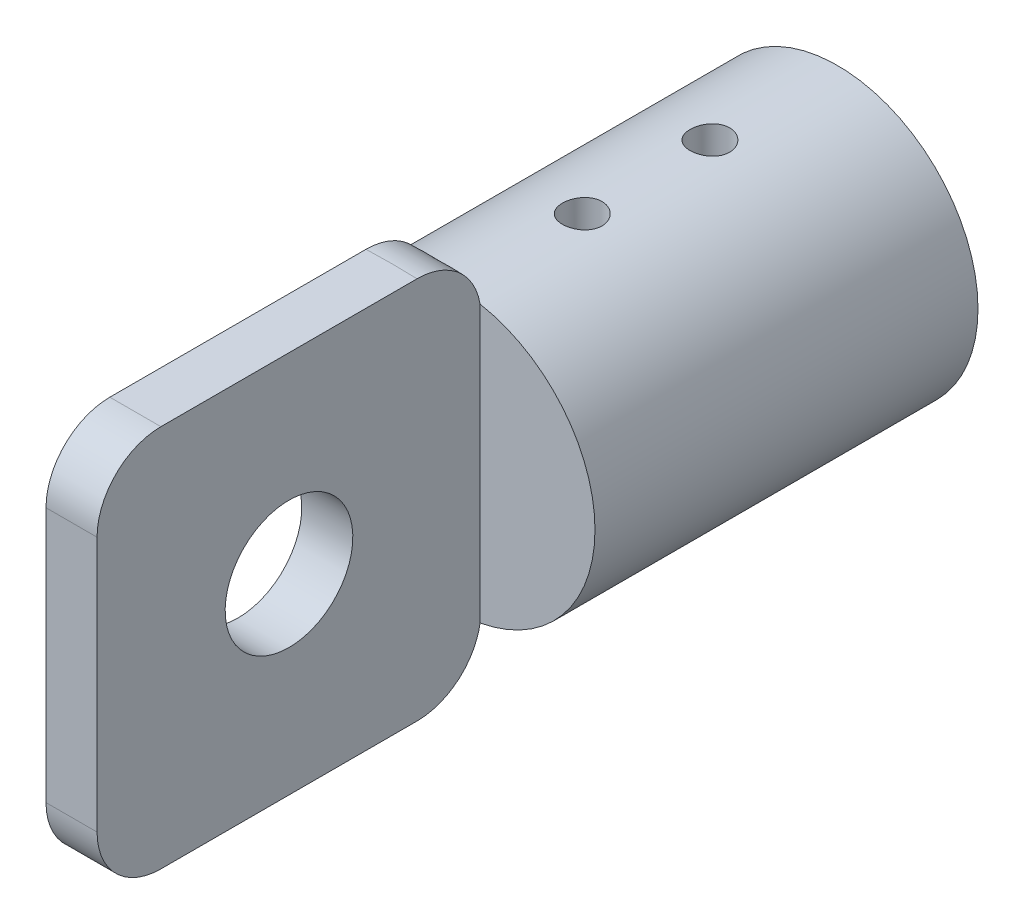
ISO-10303-21;
HEADER;
FILE_DESCRIPTION(('STEP AP214'),'2;1');
FILE_NAME('part.step','',(''),(''),'','','');
FILE_SCHEMA(('AUTOMOTIVE_DESIGN { 1 0 10303 214 1 1 1 1 }'));
ENDSEC;
DATA;
#1=APPLICATION_CONTEXT('core data for automotive mechanical design processes');
#2=APPLICATION_PROTOCOL_DEFINITION('international standard','automotive_design',2000,#1);
#3=PRODUCT_CONTEXT('',#1,'mechanical');
#4=PRODUCT('Part','Part','',(#3));
#5=PRODUCT_RELATED_PRODUCT_CATEGORY('part','',(#4));
#6=PRODUCT_DEFINITION_FORMATION('','',#4);
#7=PRODUCT_DEFINITION_CONTEXT('part definition',#1,'design');
#8=PRODUCT_DEFINITION('design','',#6,#7);
#9=PRODUCT_DEFINITION_SHAPE('','',#8);
#10=(LENGTH_UNIT() NAMED_UNIT(*) SI_UNIT(.MILLI.,.METRE.));
#11=(NAMED_UNIT(*) PLANE_ANGLE_UNIT() SI_UNIT($,.RADIAN.));
#12=(NAMED_UNIT(*) SI_UNIT($,.STERADIAN.) SOLID_ANGLE_UNIT());
#13=UNCERTAINTY_MEASURE_WITH_UNIT(LENGTH_MEASURE(1.E-05),#10,'distance_accuracy_value','');
#14=(GEOMETRIC_REPRESENTATION_CONTEXT(3) GLOBAL_UNCERTAINTY_ASSIGNED_CONTEXT((#13)) GLOBAL_UNIT_ASSIGNED_CONTEXT((#10,
#11,#12)) REPRESENTATION_CONTEXT('',''));
#15=CARTESIAN_POINT('',(0.,0.,0.));
#16=DIRECTION('',(0.,0.,1.));
#17=DIRECTION('',(1.,0.,0.));
#18=AXIS2_PLACEMENT_3D('',#15,#16,#17);
#19=CARTESIAN_POINT('',(0.,0.,30.));
#20=DIRECTION('',(0.,0.,1.));
#21=DIRECTION('',(1.,0.,0.));
#22=AXIS2_PLACEMENT_3D('',#19,#20,#21);
#23=PLANE('',#22);
#24=DIRECTION('',(0.,1.,0.));
#25=VECTOR('',#24,1.);
#26=CARTESIAN_POINT('',(2.,15.,30.));
#27=LINE('',#26,#25);
#28=CARTESIAN_POINT('',(2.,-10.816653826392,30.));
#29=VERTEX_POINT('',#28);
#30=CARTESIAN_POINT('',(2.,10.816653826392,30.));
#31=VERTEX_POINT('',#30);
#32=EDGE_CURVE('E136',#29,#31,#27,.T.);
#33=ORIENTED_EDGE('',*,*,#32,.F.);
#34=CARTESIAN_POINT('',(0.,0.,30.));
#35=DIRECTION('',(0.,0.,1.));
#36=DIRECTION('',(1.,0.,0.));
#37=AXIS2_PLACEMENT_3D('',#34,#35,#36);
#38=CIRCLE('',#37,11.);
#39=EDGE_CURVE('E127',#29,#31,#38,.T.);
#40=ORIENTED_EDGE('',*,*,#39,.T.);
#41=EDGE_LOOP('',(#33,#40));
#42=FACE_BOUND('',#41,.T.);
#43=ADVANCED_FACE('F39',(#42),#23,.T.);
#44=CARTESIAN_POINT('',(0.,0.,30.));
#45=DIRECTION('',(0.,0.,-1.));
#46=DIRECTION('',(-1.,0.,0.));
#47=AXIS2_PLACEMENT_3D('',#44,#45,#46);
#48=CYLINDRICAL_SURFACE('',#47,11.);
#49=CARTESIAN_POINT('',(0.,-11.,11.55));
#50=CARTESIAN_POINT('',(0.0866040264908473,-10.999998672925,11.5499963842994));
#51=CARTESIAN_POINT('',(0.173259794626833,-10.9989664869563,11.5427171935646));
#52=CARTESIAN_POINT('',(0.344153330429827,-10.9949482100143,11.5137977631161));
#53=CARTESIAN_POINT('',(0.42838859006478,-10.9919601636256,11.4921431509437));
#54=CARTESIAN_POINT('',(0.591942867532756,-10.9843662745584,11.4351292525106));
#55=CARTESIAN_POINT('',(0.67126539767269,-10.9797616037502,11.3997798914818));
#56=CARTESIAN_POINT('',(0.822839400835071,-10.9694445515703,11.3164032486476));
#57=CARTESIAN_POINT('',(0.895091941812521,-10.9637323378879,11.2683778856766));
#58=CARTESIAN_POINT('',(1.03098880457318,-10.9517921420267,11.1606575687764));
#59=CARTESIAN_POINT('',(1.09457705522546,-10.945561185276,11.1008921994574));
#60=CARTESIAN_POINT('',(1.21085684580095,-10.9333093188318,10.9715398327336));
#61=CARTESIAN_POINT('',(1.26354778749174,-10.9272884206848,10.9019522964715));
#62=CARTESIAN_POINT('',(1.35675208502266,-10.9161094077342,10.7545587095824));
#63=CARTESIAN_POINT('',(1.39721182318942,-10.910955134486,10.6767184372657));
#64=CARTESIAN_POINT('',(1.46446265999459,-10.902133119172,10.5152627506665));
#65=CARTESIAN_POINT('',(1.49125441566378,-10.8984653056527,10.4316476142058));
#66=CARTESIAN_POINT('',(1.53023599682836,-10.8930604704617,10.2616027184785));
#67=CARTESIAN_POINT('',(1.5425213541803,-10.8913108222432,10.1751952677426));
#68=CARTESIAN_POINT('',(1.55243722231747,-10.8899019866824,10.0015288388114));
#69=CARTESIAN_POINT('',(1.5500684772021,-10.890242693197,9.91426990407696));
#70=CARTESIAN_POINT('',(1.530821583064,-10.8929645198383,9.74204880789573));
#71=CARTESIAN_POINT('',(1.51404938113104,-10.8953307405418,9.65707453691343));
#72=CARTESIAN_POINT('',(1.46663731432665,-10.9018137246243,9.49115857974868));
#73=CARTESIAN_POINT('',(1.43599709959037,-10.9059305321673,9.4102169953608));
#74=CARTESIAN_POINT('',(1.36160716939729,-10.9154674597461,9.25433909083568));
#75=CARTESIAN_POINT('',(1.31781213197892,-10.920892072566,9.17942468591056));
#76=CARTESIAN_POINT('',(1.21838806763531,-10.9324300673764,9.03796808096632));
#77=CARTESIAN_POINT('',(1.16275835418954,-10.9385434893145,8.97142636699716));
#78=CARTESIAN_POINT('',(1.04066034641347,-10.9508362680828,8.84798962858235));
#79=CARTESIAN_POINT('',(0.974100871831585,-10.9570157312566,8.79118476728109));
#80=CARTESIAN_POINT('',(0.832344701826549,-10.9686941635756,8.68953867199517));
#81=CARTESIAN_POINT('',(0.757147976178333,-10.9741931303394,8.64469747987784));
#82=CARTESIAN_POINT('',(0.600177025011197,-10.9838957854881,8.56824872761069));
#83=CARTESIAN_POINT('',(0.518399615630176,-10.9880988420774,8.53664761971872));
#84=CARTESIAN_POINT('',(0.350626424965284,-10.9947306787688,8.48765183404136));
#85=CARTESIAN_POINT('',(0.264630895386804,-10.9971595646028,8.4702563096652));
#86=CARTESIAN_POINT('',(0.0916412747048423,-10.9999554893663,8.45028421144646));
#87=CARTESIAN_POINT('',(0.0046617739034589,-11.0003397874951,8.44758358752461));
#88=CARTESIAN_POINT('',(-0.168508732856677,-10.9990500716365,8.45674941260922));
#89=CARTESIAN_POINT('',(-0.254699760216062,-10.9973761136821,8.46861546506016));
#90=CARTESIAN_POINT('',(-0.423474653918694,-10.9921686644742,8.50647468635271));
#91=CARTESIAN_POINT('',(-0.506072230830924,-10.9886430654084,8.53240791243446));
#92=CARTESIAN_POINT('',(-0.665746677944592,-10.9801265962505,8.59760246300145));
#93=CARTESIAN_POINT('',(-0.742823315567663,-10.9751356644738,8.6368643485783));
#94=CARTESIAN_POINT('',(-0.889816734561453,-10.9642008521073,8.72789623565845));
#95=CARTESIAN_POINT('',(-0.959683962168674,-10.9582510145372,8.7797455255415));
#96=CARTESIAN_POINT('',(-1.08976922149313,-10.9460805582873,8.89436934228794));
#97=CARTESIAN_POINT('',(-1.14998676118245,-10.9398599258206,8.95714442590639));
#98=CARTESIAN_POINT('',(-1.25951036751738,-10.9277948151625,9.09238794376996));
#99=CARTESIAN_POINT('',(-1.30873362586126,-10.9219534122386,9.16492375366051));
#100=CARTESIAN_POINT('',(-1.39429716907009,-10.9113611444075,9.31730665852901));
#101=CARTESIAN_POINT('',(-1.43063776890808,-10.906610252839,9.39715357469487));
#102=CARTESIAN_POINT('',(-1.48927386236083,-10.8987587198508,9.56163744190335));
#103=CARTESIAN_POINT('',(-1.51161412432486,-10.8956528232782,9.64625817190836));
#104=CARTESIAN_POINT('',(-1.54175856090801,-10.89142856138,9.81809712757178));
#105=CARTESIAN_POINT('',(-1.54956361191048,-10.890310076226,9.90531519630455));
#106=CARTESIAN_POINT('',(-1.55039704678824,-10.8901913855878,10.0790483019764));
#107=CARTESIAN_POINT('',(-1.54355558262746,-10.8911725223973,10.1655627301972));
#108=CARTESIAN_POINT('',(-1.51556783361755,-10.8951021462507,10.3361980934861));
#109=CARTESIAN_POINT('',(-1.49442156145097,-10.8980506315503,10.4203190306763));
#110=CARTESIAN_POINT('',(-1.43846848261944,-10.9055764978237,10.5837506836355));
#111=CARTESIAN_POINT('',(-1.40366969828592,-10.9101529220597,10.663064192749));
#112=CARTESIAN_POINT('',(-1.32141223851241,-10.9204203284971,10.8147478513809));
#113=CARTESIAN_POINT('',(-1.27395323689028,-10.9261113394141,10.8871178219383));
#114=CARTESIAN_POINT('',(-1.16724566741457,-10.9380270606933,11.0235230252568));
#115=CARTESIAN_POINT('',(-1.10790043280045,-10.944255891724,11.0874822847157));
#116=CARTESIAN_POINT('',(-0.979308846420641,-10.9565102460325,11.2045817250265));
#117=CARTESIAN_POINT('',(-0.910060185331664,-10.9625357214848,11.2577193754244));
#118=CARTESIAN_POINT('',(-0.763236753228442,-10.9737373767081,11.3518931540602));
#119=CARTESIAN_POINT('',(-0.68562336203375,-10.9789093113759,11.3928695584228));
#120=CARTESIAN_POINT('',(-0.524582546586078,-10.9877791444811,11.4611454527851));
#121=CARTESIAN_POINT('',(-0.441161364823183,-10.991478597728,11.4884593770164));
#122=CARTESIAN_POINT('',(-0.297785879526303,-10.9961238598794,11.5223062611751));
#123=CARTESIAN_POINT('',(-0.238724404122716,-10.9975700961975,11.5326759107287));
#124=CARTESIAN_POINT('',(-0.119783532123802,-10.9995086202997,11.5465239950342));
#125=CARTESIAN_POINT('',(-0.0599041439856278,-11.0000009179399,11.5500025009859));
#126=CARTESIAN_POINT('',(0.,-11.,11.55));
#127=B_SPLINE_CURVE_WITH_KNOTS('',3,(#49,#50,#51,#52,#53,#54,#55,#56,#57,#58,#59,#60,#61,#62,
#63,#64,#65,#66,#67,#68,#69,#70,#71,#72,#73,#74,#75,#76,#77,#78,#79,#80,#81,#82,#83,#84,#85,#86,
#87,#88,#89,#90,#91,#92,#93,#94,#95,#96,#97,#98,#99,#100,#101,#102,#103,#104,#105,#106,#107,
#108,#109,#110,#111,#112,#113,#114,#115,#116,#117,#118,#119,#120,#121,#122,#123,#124,#125,#126),
.UNSPECIFIED.,.T.,.F.,(4,2,2,2,2,2,2,2,2,2,2,2,2,2,2,2,2,2,2,2,2,2,2,2,2,2,2,2,2,2,2,2,2,2,2,2,
2,2,4),(0.,0.259593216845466,0.51944636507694,0.779111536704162,1.03873742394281,
1.2999708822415,1.56121867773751,1.82359562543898,2.08595995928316,2.34658668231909,
2.60720017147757,2.86591293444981,3.12463222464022,3.38425330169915,3.64388944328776,
3.90581324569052,4.16773796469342,4.4297901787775,4.6918267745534,4.95164786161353,
5.2114618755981,5.47017737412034,5.72890376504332,5.98930421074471,6.24971792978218,
6.5120314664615,6.77433858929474,7.03580260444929,7.29725085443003,7.55638547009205,
7.81551985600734,8.07450219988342,8.33349121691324,8.59467891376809,8.85592761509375,
9.11843884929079,9.38067215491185,9.56023505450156,9.73979609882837),.UNSPECIFIED.);
#128=CARTESIAN_POINT('',(0.,-11.,11.55));
#129=VERTEX_POINT('',#128);
#130=EDGE_CURVE('E262',#129,#129,#127,.T.);
#131=ORIENTED_EDGE('',*,*,#130,.T.);
#132=EDGE_LOOP('',(#131));
#133=FACE_BOUND('',#132,.T.);
#134=CARTESIAN_POINT('',(0.,11.,11.55));
#135=CARTESIAN_POINT('',(-0.0866040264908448,10.999998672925,11.5499963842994));
#136=CARTESIAN_POINT('',(-0.17325979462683,10.9989664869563,11.5427171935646));
#137=CARTESIAN_POINT('',(-0.344153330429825,10.9949482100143,11.5137977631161));
#138=CARTESIAN_POINT('',(-0.428388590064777,10.9919601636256,11.4921431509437));
#139=CARTESIAN_POINT('',(-0.591942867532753,10.9843662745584,11.4351292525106));
#140=CARTESIAN_POINT('',(-0.671265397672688,10.9797616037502,11.3997798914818));
#141=CARTESIAN_POINT('',(-0.822839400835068,10.9694445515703,11.3164032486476));
#142=CARTESIAN_POINT('',(-0.895091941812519,10.9637323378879,11.2683778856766));
#143=CARTESIAN_POINT('',(-1.03098880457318,10.9517921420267,11.1606575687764));
#144=CARTESIAN_POINT('',(-1.09457705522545,10.945561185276,11.1008921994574));
#145=CARTESIAN_POINT('',(-1.21085684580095,10.9333093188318,10.9715398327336));
#146=CARTESIAN_POINT('',(-1.26354778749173,10.9272884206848,10.9019522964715));
#147=CARTESIAN_POINT('',(-1.35675208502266,10.9161094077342,10.7545587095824));
#148=CARTESIAN_POINT('',(-1.39721182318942,10.910955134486,10.6767184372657));
#149=CARTESIAN_POINT('',(-1.46446265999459,10.902133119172,10.5152627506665));
#150=CARTESIAN_POINT('',(-1.49125441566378,10.8984653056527,10.4316476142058));
#151=CARTESIAN_POINT('',(-1.53023599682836,10.8930604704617,10.2616027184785));
#152=CARTESIAN_POINT('',(-1.5425213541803,10.8913108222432,10.1751952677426));
#153=CARTESIAN_POINT('',(-1.55243722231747,10.8899019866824,10.0015288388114));
#154=CARTESIAN_POINT('',(-1.5500684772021,10.890242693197,9.91426990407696));
#155=CARTESIAN_POINT('',(-1.53082158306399,10.8929645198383,9.74204880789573));
#156=CARTESIAN_POINT('',(-1.51404938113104,10.8953307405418,9.65707453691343));
#157=CARTESIAN_POINT('',(-1.46663731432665,10.9018137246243,9.49115857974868));
#158=CARTESIAN_POINT('',(-1.43599709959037,10.9059305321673,9.4102169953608));
#159=CARTESIAN_POINT('',(-1.36160716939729,10.9154674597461,9.25433909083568));
#160=CARTESIAN_POINT('',(-1.31781213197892,10.920892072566,9.17942468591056));
#161=CARTESIAN_POINT('',(-1.21838806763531,10.9324300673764,9.03796808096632));
#162=CARTESIAN_POINT('',(-1.16275835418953,10.9385434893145,8.97142636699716));
#163=CARTESIAN_POINT('',(-1.04066034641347,10.9508362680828,8.84798962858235));
#164=CARTESIAN_POINT('',(-0.974100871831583,10.9570157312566,8.79118476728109));
#165=CARTESIAN_POINT('',(-0.832344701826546,10.9686941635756,8.68953867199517));
#166=CARTESIAN_POINT('',(-0.75714797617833,10.9741931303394,8.64469747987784));
#167=CARTESIAN_POINT('',(-0.600177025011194,10.9838957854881,8.56824872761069));
#168=CARTESIAN_POINT('',(-0.518399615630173,10.9880988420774,8.53664761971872));
#169=CARTESIAN_POINT('',(-0.350626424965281,10.9947306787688,8.48765183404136));
#170=CARTESIAN_POINT('',(-0.264630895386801,10.9971595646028,8.4702563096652));
#171=CARTESIAN_POINT('',(-0.0916412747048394,10.9999554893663,8.45028421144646));
#172=CARTESIAN_POINT('',(-0.0046617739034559,11.0003397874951,8.44758358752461));
#173=CARTESIAN_POINT('',(0.168508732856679,10.9990500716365,8.45674941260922));
#174=CARTESIAN_POINT('',(0.254699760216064,10.9973761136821,8.46861546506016));
#175=CARTESIAN_POINT('',(0.423474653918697,10.9921686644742,8.50647468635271));
#176=CARTESIAN_POINT('',(0.506072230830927,10.9886430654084,8.53240791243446));
#177=CARTESIAN_POINT('',(0.665746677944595,10.9801265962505,8.59760246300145));
#178=CARTESIAN_POINT('',(0.742823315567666,10.9751356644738,8.6368643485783));
#179=CARTESIAN_POINT('',(0.889816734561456,10.9642008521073,8.72789623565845));
#180=CARTESIAN_POINT('',(0.959683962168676,10.9582510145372,8.7797455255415));
#181=CARTESIAN_POINT('',(1.08976922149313,10.9460805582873,8.89436934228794));
#182=CARTESIAN_POINT('',(1.14998676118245,10.9398599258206,8.95714442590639));
#183=CARTESIAN_POINT('',(1.25951036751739,10.9277948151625,9.09238794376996));
#184=CARTESIAN_POINT('',(1.30873362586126,10.9219534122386,9.16492375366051));
#185=CARTESIAN_POINT('',(1.39429716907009,10.9113611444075,9.31730665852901));
#186=CARTESIAN_POINT('',(1.43063776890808,10.906610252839,9.39715357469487));
#187=CARTESIAN_POINT('',(1.48927386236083,10.8987587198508,9.56163744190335));
#188=CARTESIAN_POINT('',(1.51161412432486,10.8956528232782,9.64625817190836));
#189=CARTESIAN_POINT('',(1.54175856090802,10.89142856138,9.81809712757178));
#190=CARTESIAN_POINT('',(1.54956361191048,10.890310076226,9.90531519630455));
#191=CARTESIAN_POINT('',(1.55039704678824,10.8901913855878,10.0790483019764));
#192=CARTESIAN_POINT('',(1.54355558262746,10.8911725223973,10.1655627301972));
#193=CARTESIAN_POINT('',(1.51556783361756,10.8951021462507,10.3361980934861));
#194=CARTESIAN_POINT('',(1.49442156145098,10.8980506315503,10.4203190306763));
#195=CARTESIAN_POINT('',(1.43846848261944,10.9055764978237,10.5837506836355));
#196=CARTESIAN_POINT('',(1.40366969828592,10.9101529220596,10.663064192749));
#197=CARTESIAN_POINT('',(1.32141223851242,10.9204203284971,10.8147478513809));
#198=CARTESIAN_POINT('',(1.27395323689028,10.9261113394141,10.8871178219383));
#199=CARTESIAN_POINT('',(1.16724566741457,10.9380270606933,11.0235230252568));
#200=CARTESIAN_POINT('',(1.10790043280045,10.944255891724,11.0874822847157));
#201=CARTESIAN_POINT('',(0.979308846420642,10.9565102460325,11.2045817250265));
#202=CARTESIAN_POINT('',(0.910060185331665,10.9625357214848,11.2577193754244));
#203=CARTESIAN_POINT('',(0.763236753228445,10.9737373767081,11.3518931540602));
#204=CARTESIAN_POINT('',(0.685623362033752,10.9789093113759,11.3928695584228));
#205=CARTESIAN_POINT('',(0.52458254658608,10.9877791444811,11.4611454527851));
#206=CARTESIAN_POINT('',(0.441161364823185,10.991478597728,11.4884593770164));
#207=CARTESIAN_POINT('',(0.297785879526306,10.9961238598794,11.5223062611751));
#208=CARTESIAN_POINT('',(0.23872440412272,10.9975700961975,11.5326759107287));
#209=CARTESIAN_POINT('',(0.119783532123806,10.9995086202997,11.5465239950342));
#210=CARTESIAN_POINT('',(0.059904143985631,11.0000009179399,11.5500025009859));
#211=CARTESIAN_POINT('',(0.,11.,11.55));
#212=B_SPLINE_CURVE_WITH_KNOTS('',3,(#134,#135,#136,#137,#138,#139,#140,#141,#142,#143,#144,
#145,#146,#147,#148,#149,#150,#151,#152,#153,#154,#155,#156,#157,#158,#159,#160,#161,#162,#163,
#164,#165,#166,#167,#168,#169,#170,#171,#172,#173,#174,#175,#176,#177,#178,#179,#180,#181,#182,
#183,#184,#185,#186,#187,#188,#189,#190,#191,#192,#193,#194,#195,#196,#197,#198,#199,#200,#201,
#202,#203,#204,#205,#206,#207,#208,#209,#210,#211),.UNSPECIFIED.,.T.,.F.,(4,2,2,2,2,2,2,2,2,2,2,
2,2,2,2,2,2,2,2,2,2,2,2,2,2,2,2,2,2,2,2,2,2,2,2,2,2,2,4),(0.,0.259593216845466,0.51944636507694,
0.779111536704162,1.03873742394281,1.2999708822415,1.56121867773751,1.82359562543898,
2.08595995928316,2.34658668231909,2.60720017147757,2.86591293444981,3.12463222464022,
3.38425330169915,3.64388944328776,3.90581324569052,4.16773796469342,4.4297901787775,
4.6918267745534,4.95164786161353,5.2114618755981,5.47017737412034,5.72890376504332,
5.98930421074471,6.24971792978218,6.51203146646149,6.77433858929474,7.03580260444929,
7.29725085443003,7.55638547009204,7.81551985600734,8.07450219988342,8.33349121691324,
8.5946789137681,8.85592761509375,9.11843884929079,9.38067215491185,9.56023505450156,
9.73979609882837),.UNSPECIFIED.);
#213=CARTESIAN_POINT('',(0.,11.,11.55));
#214=VERTEX_POINT('',#213);
#215=EDGE_CURVE('E256',#214,#214,#212,.T.);
#216=ORIENTED_EDGE('',*,*,#215,.T.);
#217=EDGE_LOOP('',(#216));
#218=FACE_BOUND('',#217,.T.);
#219=CARTESIAN_POINT('',(0.,-11.,21.55));
#220=CARTESIAN_POINT('',(0.0866040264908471,-10.999998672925,21.5499963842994));
#221=CARTESIAN_POINT('',(0.173259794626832,-10.9989664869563,21.5427171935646));
#222=CARTESIAN_POINT('',(0.344153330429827,-10.9949482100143,21.5137977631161));
#223=CARTESIAN_POINT('',(0.428388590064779,-10.9919601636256,21.4921431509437));
#224=CARTESIAN_POINT('',(0.591942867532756,-10.9843662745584,21.4351292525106));
#225=CARTESIAN_POINT('',(0.67126539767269,-10.9797616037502,21.3997798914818));
#226=CARTESIAN_POINT('',(0.822839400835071,-10.9694445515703,21.3164032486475));
#227=CARTESIAN_POINT('',(0.895091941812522,-10.9637323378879,21.2683778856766));
#228=CARTESIAN_POINT('',(1.03098880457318,-10.9517921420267,21.1606575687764));
#229=CARTESIAN_POINT('',(1.09457705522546,-10.945561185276,21.1008921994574));
#230=CARTESIAN_POINT('',(1.21085684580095,-10.9333093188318,20.9715398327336));
#231=CARTESIAN_POINT('',(1.26354778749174,-10.9272884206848,20.9019522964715));
#232=CARTESIAN_POINT('',(1.35675208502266,-10.9161094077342,20.7545587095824));
#233=CARTESIAN_POINT('',(1.39721182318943,-10.910955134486,20.6767184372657));
#234=CARTESIAN_POINT('',(1.46446265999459,-10.902133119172,20.5152627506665));
#235=CARTESIAN_POINT('',(1.49125441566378,-10.8984653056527,20.4316476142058));
#236=CARTESIAN_POINT('',(1.53023599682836,-10.8930604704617,20.2616027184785));
#237=CARTESIAN_POINT('',(1.5425213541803,-10.8913108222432,20.1751952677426));
#238=CARTESIAN_POINT('',(1.55243722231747,-10.8899019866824,20.0015288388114));
#239=CARTESIAN_POINT('',(1.5500684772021,-10.890242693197,19.914269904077));
#240=CARTESIAN_POINT('',(1.530821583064,-10.8929645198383,19.7420488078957));
#241=CARTESIAN_POINT('',(1.51404938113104,-10.8953307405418,19.6570745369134));
#242=CARTESIAN_POINT('',(1.46663731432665,-10.9018137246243,19.4911585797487));
#243=CARTESIAN_POINT('',(1.43599709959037,-10.9059305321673,19.4102169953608));
#244=CARTESIAN_POINT('',(1.36160716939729,-10.9154674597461,19.2543390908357));
#245=CARTESIAN_POINT('',(1.31781213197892,-10.920892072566,19.1794246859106));
#246=CARTESIAN_POINT('',(1.21838806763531,-10.9324300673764,19.0379680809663));
#247=CARTESIAN_POINT('',(1.16275835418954,-10.9385434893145,18.9714263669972));
#248=CARTESIAN_POINT('',(1.04066034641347,-10.9508362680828,18.8479896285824));
#249=CARTESIAN_POINT('',(0.974100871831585,-10.9570157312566,18.7911847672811));
#250=CARTESIAN_POINT('',(0.832344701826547,-10.9686941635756,18.6895386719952));
#251=CARTESIAN_POINT('',(0.757147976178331,-10.9741931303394,18.6446974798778));
#252=CARTESIAN_POINT('',(0.600177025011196,-10.9838957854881,18.5682487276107));
#253=CARTESIAN_POINT('',(0.518399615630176,-10.9880988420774,18.5366476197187));
#254=CARTESIAN_POINT('',(0.350626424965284,-10.9947306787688,18.4876518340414));
#255=CARTESIAN_POINT('',(0.264630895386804,-10.9971595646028,18.4702563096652));
#256=CARTESIAN_POINT('',(0.0916412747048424,-10.9999554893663,18.4502842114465));
#257=CARTESIAN_POINT('',(0.00466177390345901,-11.0003397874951,18.4475835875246));
#258=CARTESIAN_POINT('',(-0.168508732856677,-10.9990500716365,18.4567494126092));
#259=CARTESIAN_POINT('',(-0.254699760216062,-10.9973761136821,18.4686154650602));
#260=CARTESIAN_POINT('',(-0.423474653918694,-10.9921686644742,18.5064746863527));
#261=CARTESIAN_POINT('',(-0.506072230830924,-10.9886430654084,18.5324079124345));
#262=CARTESIAN_POINT('',(-0.665746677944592,-10.9801265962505,18.5976024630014));
#263=CARTESIAN_POINT('',(-0.742823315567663,-10.9751356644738,18.6368643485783));
#264=CARTESIAN_POINT('',(-0.889816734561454,-10.9642008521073,18.7278962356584));
#265=CARTESIAN_POINT('',(-0.959683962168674,-10.9582510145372,18.7797455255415));
#266=CARTESIAN_POINT('',(-1.08976922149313,-10.9460805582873,18.8943693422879));
#267=CARTESIAN_POINT('',(-1.14998676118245,-10.9398599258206,18.9571444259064));
#268=CARTESIAN_POINT('',(-1.25951036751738,-10.9277948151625,19.09238794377));
#269=CARTESIAN_POINT('',(-1.30873362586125,-10.9219534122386,19.1649237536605));
#270=CARTESIAN_POINT('',(-1.39429716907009,-10.9113611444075,19.317306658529));
#271=CARTESIAN_POINT('',(-1.43063776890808,-10.906610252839,19.3971535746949));
#272=CARTESIAN_POINT('',(-1.48927386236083,-10.8987587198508,19.5616374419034));
#273=CARTESIAN_POINT('',(-1.51161412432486,-10.8956528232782,19.6462581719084));
#274=CARTESIAN_POINT('',(-1.54175856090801,-10.89142856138,19.8180971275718));
#275=CARTESIAN_POINT('',(-1.54956361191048,-10.890310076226,19.9053151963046));
#276=CARTESIAN_POINT('',(-1.55039704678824,-10.8901913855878,20.0790483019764));
#277=CARTESIAN_POINT('',(-1.54355558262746,-10.8911725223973,20.1655627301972));
#278=CARTESIAN_POINT('',(-1.51556783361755,-10.8951021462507,20.3361980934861));
#279=CARTESIAN_POINT('',(-1.49442156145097,-10.8980506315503,20.4203190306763));
#280=CARTESIAN_POINT('',(-1.43846848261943,-10.9055764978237,20.5837506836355));
#281=CARTESIAN_POINT('',(-1.40366969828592,-10.9101529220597,20.663064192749));
#282=CARTESIAN_POINT('',(-1.32141223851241,-10.9204203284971,20.8147478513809));
#283=CARTESIAN_POINT('',(-1.27395323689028,-10.9261113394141,20.8871178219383));
#284=CARTESIAN_POINT('',(-1.16724566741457,-10.9380270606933,21.0235230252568));
#285=CARTESIAN_POINT('',(-1.10790043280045,-10.944255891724,21.0874822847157));
#286=CARTESIAN_POINT('',(-0.979308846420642,-10.9565102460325,21.2045817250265));
#287=CARTESIAN_POINT('',(-0.910060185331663,-10.9625357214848,21.2577193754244));
#288=CARTESIAN_POINT('',(-0.763236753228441,-10.9737373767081,21.3518931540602));
#289=CARTESIAN_POINT('',(-0.685623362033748,-10.9789093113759,21.3928695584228));
#290=CARTESIAN_POINT('',(-0.524582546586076,-10.9877791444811,21.4611454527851));
#291=CARTESIAN_POINT('',(-0.441161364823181,-10.991478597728,21.4884593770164));
#292=CARTESIAN_POINT('',(-0.297785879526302,-10.9961238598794,21.5223062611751));
#293=CARTESIAN_POINT('',(-0.238724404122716,-10.9975700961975,21.5326759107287));
#294=CARTESIAN_POINT('',(-0.119783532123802,-10.9995086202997,21.5465239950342));
#295=CARTESIAN_POINT('',(-0.059904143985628,-11.0000009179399,21.5500025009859));
#296=CARTESIAN_POINT('',(0.,-11.,21.55));
#297=B_SPLINE_CURVE_WITH_KNOTS('',3,(#219,#220,#221,#222,#223,#224,#225,#226,#227,#228,#229,
#230,#231,#232,#233,#234,#235,#236,#237,#238,#239,#240,#241,#242,#243,#244,#245,#246,#247,#248,
#249,#250,#251,#252,#253,#254,#255,#256,#257,#258,#259,#260,#261,#262,#263,#264,#265,#266,#267,
#268,#269,#270,#271,#272,#273,#274,#275,#276,#277,#278,#279,#280,#281,#282,#283,#284,#285,#286,
#287,#288,#289,#290,#291,#292,#293,#294,#295,#296),.UNSPECIFIED.,.T.,.F.,(4,2,2,2,2,2,2,2,2,2,2,
2,2,2,2,2,2,2,2,2,2,2,2,2,2,2,2,2,2,2,2,2,2,2,2,2,2,2,4),(0.,0.259593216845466,0.51944636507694,
0.779111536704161,1.03873742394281,1.2999708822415,1.56121867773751,1.82359562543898,
2.08595995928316,2.34658668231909,2.60720017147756,2.86591293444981,3.12463222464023,
3.38425330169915,3.64388944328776,3.90581324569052,4.16773796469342,4.4297901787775,
4.6918267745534,4.95164786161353,5.2114618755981,5.47017737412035,5.72890376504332,
5.98930421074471,6.24971792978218,6.5120314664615,6.77433858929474,7.0358026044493,
7.29725085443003,7.55638547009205,7.81551985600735,8.07450219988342,8.33349121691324,
8.59467891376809,8.85592761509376,9.11843884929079,9.38067215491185,9.56023505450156,
9.73979609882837),.UNSPECIFIED.);
#298=CARTESIAN_POINT('',(0.,-11.,21.55));
#299=VERTEX_POINT('',#298);
#300=EDGE_CURVE('E250',#299,#299,#297,.T.);
#301=ORIENTED_EDGE('',*,*,#300,.T.);
#302=EDGE_LOOP('',(#301));
#303=FACE_BOUND('',#302,.T.);
#304=CARTESIAN_POINT('',(0.,11.,21.55));
#305=CARTESIAN_POINT('',(-0.0866040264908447,10.999998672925,21.5499963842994));
#306=CARTESIAN_POINT('',(-0.17325979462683,10.9989664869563,21.5427171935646));
#307=CARTESIAN_POINT('',(-0.344153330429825,10.9949482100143,21.5137977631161));
#308=CARTESIAN_POINT('',(-0.428388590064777,10.9919601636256,21.4921431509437));
#309=CARTESIAN_POINT('',(-0.591942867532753,10.9843662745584,21.4351292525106));
#310=CARTESIAN_POINT('',(-0.671265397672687,10.9797616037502,21.3997798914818));
#311=CARTESIAN_POINT('',(-0.822839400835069,10.9694445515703,21.3164032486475));
#312=CARTESIAN_POINT('',(-0.895091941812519,10.9637323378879,21.2683778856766));
#313=CARTESIAN_POINT('',(-1.03098880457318,10.9517921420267,21.1606575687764));
#314=CARTESIAN_POINT('',(-1.09457705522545,10.945561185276,21.1008921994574));
#315=CARTESIAN_POINT('',(-1.21085684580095,10.9333093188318,20.9715398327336));
#316=CARTESIAN_POINT('',(-1.26354778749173,10.9272884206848,20.9019522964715));
#317=CARTESIAN_POINT('',(-1.35675208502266,10.9161094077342,20.7545587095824));
#318=CARTESIAN_POINT('',(-1.39721182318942,10.910955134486,20.6767184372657));
#319=CARTESIAN_POINT('',(-1.46446265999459,10.902133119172,20.5152627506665));
#320=CARTESIAN_POINT('',(-1.49125441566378,10.8984653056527,20.4316476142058));
#321=CARTESIAN_POINT('',(-1.53023599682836,10.8930604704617,20.2616027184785));
#322=CARTESIAN_POINT('',(-1.5425213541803,10.8913108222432,20.1751952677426));
#323=CARTESIAN_POINT('',(-1.55243722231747,10.8899019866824,20.0015288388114));
#324=CARTESIAN_POINT('',(-1.5500684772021,10.890242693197,19.914269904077));
#325=CARTESIAN_POINT('',(-1.53082158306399,10.8929645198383,19.7420488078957));
#326=CARTESIAN_POINT('',(-1.51404938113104,10.8953307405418,19.6570745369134));
#327=CARTESIAN_POINT('',(-1.46663731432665,10.9018137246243,19.4911585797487));
#328=CARTESIAN_POINT('',(-1.43599709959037,10.9059305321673,19.4102169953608));
#329=CARTESIAN_POINT('',(-1.36160716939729,10.9154674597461,19.2543390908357));
#330=CARTESIAN_POINT('',(-1.31781213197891,10.920892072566,19.1794246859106));
#331=CARTESIAN_POINT('',(-1.21838806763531,10.9324300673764,19.0379680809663));
#332=CARTESIAN_POINT('',(-1.16275835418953,10.9385434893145,18.9714263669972));
#333=CARTESIAN_POINT('',(-1.04066034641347,10.9508362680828,18.8479896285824));
#334=CARTESIAN_POINT('',(-0.974100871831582,10.9570157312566,18.7911847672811));
#335=CARTESIAN_POINT('',(-0.832344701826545,10.9686941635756,18.6895386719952));
#336=CARTESIAN_POINT('',(-0.757147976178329,10.9741931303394,18.6446974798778));
#337=CARTESIAN_POINT('',(-0.600177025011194,10.9838957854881,18.5682487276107));
#338=CARTESIAN_POINT('',(-0.518399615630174,10.9880988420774,18.5366476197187));
#339=CARTESIAN_POINT('',(-0.350626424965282,10.9947306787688,18.4876518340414));
#340=CARTESIAN_POINT('',(-0.264630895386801,10.9971595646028,18.4702563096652));
#341=CARTESIAN_POINT('',(-0.0916412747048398,10.9999554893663,18.4502842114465));
#342=CARTESIAN_POINT('',(-0.00466177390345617,11.0003397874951,18.4475835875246));
#343=CARTESIAN_POINT('',(0.168508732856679,10.9990500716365,18.4567494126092));
#344=CARTESIAN_POINT('',(0.254699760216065,10.9973761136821,18.4686154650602));
#345=CARTESIAN_POINT('',(0.423474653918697,10.9921686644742,18.5064746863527));
#346=CARTESIAN_POINT('',(0.506072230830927,10.9886430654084,18.5324079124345));
#347=CARTESIAN_POINT('',(0.665746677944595,10.9801265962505,18.5976024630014));
#348=CARTESIAN_POINT('',(0.742823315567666,10.9751356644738,18.6368643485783));
#349=CARTESIAN_POINT('',(0.889816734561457,10.9642008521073,18.7278962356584));
#350=CARTESIAN_POINT('',(0.959683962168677,10.9582510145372,18.7797455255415));
#351=CARTESIAN_POINT('',(1.08976922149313,10.9460805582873,18.8943693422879));
#352=CARTESIAN_POINT('',(1.14998676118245,10.9398599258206,18.9571444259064));
#353=CARTESIAN_POINT('',(1.25951036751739,10.9277948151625,19.09238794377));
#354=CARTESIAN_POINT('',(1.30873362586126,10.9219534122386,19.1649237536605));
#355=CARTESIAN_POINT('',(1.39429716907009,10.9113611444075,19.317306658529));
#356=CARTESIAN_POINT('',(1.43063776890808,10.906610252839,19.3971535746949));
#357=CARTESIAN_POINT('',(1.48927386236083,10.8987587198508,19.5616374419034));
#358=CARTESIAN_POINT('',(1.51161412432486,10.8956528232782,19.6462581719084));
#359=CARTESIAN_POINT('',(1.54175856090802,10.89142856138,19.8180971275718));
#360=CARTESIAN_POINT('',(1.54956361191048,10.890310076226,19.9053151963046));
#361=CARTESIAN_POINT('',(1.55039704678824,10.8901913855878,20.0790483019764));
#362=CARTESIAN_POINT('',(1.54355558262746,10.8911725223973,20.1655627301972));
#363=CARTESIAN_POINT('',(1.51556783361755,10.8951021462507,20.3361980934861));
#364=CARTESIAN_POINT('',(1.49442156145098,10.8980506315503,20.4203190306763));
#365=CARTESIAN_POINT('',(1.43846848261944,10.9055764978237,20.5837506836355));
#366=CARTESIAN_POINT('',(1.40366969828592,10.9101529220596,20.663064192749));
#367=CARTESIAN_POINT('',(1.32141223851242,10.9204203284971,20.8147478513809));
#368=CARTESIAN_POINT('',(1.27395323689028,10.9261113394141,20.8871178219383));
#369=CARTESIAN_POINT('',(1.16724566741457,10.9380270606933,21.0235230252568));
#370=CARTESIAN_POINT('',(1.10790043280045,10.944255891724,21.0874822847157));
#371=CARTESIAN_POINT('',(0.979308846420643,10.9565102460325,21.2045817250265));
#372=CARTESIAN_POINT('',(0.910060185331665,10.9625357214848,21.2577193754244));
#373=CARTESIAN_POINT('',(0.763236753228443,10.9737373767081,21.3518931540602));
#374=CARTESIAN_POINT('',(0.68562336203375,10.9789093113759,21.3928695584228));
#375=CARTESIAN_POINT('',(0.524582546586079,10.9877791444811,21.4611454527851));
#376=CARTESIAN_POINT('',(0.441161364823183,10.991478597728,21.4884593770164));
#377=CARTESIAN_POINT('',(0.297785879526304,10.9961238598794,21.5223062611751));
#378=CARTESIAN_POINT('',(0.238724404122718,10.9975700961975,21.5326759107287));
#379=CARTESIAN_POINT('',(0.119783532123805,10.9995086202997,21.5465239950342));
#380=CARTESIAN_POINT('',(0.0599041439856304,11.0000009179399,21.5500025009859));
#381=CARTESIAN_POINT('',(0.,11.,21.55));
#382=B_SPLINE_CURVE_WITH_KNOTS('',3,(#304,#305,#306,#307,#308,#309,#310,#311,#312,#313,#314,
#315,#316,#317,#318,#319,#320,#321,#322,#323,#324,#325,#326,#327,#328,#329,#330,#331,#332,#333,
#334,#335,#336,#337,#338,#339,#340,#341,#342,#343,#344,#345,#346,#347,#348,#349,#350,#351,#352,
#353,#354,#355,#356,#357,#358,#359,#360,#361,#362,#363,#364,#365,#366,#367,#368,#369,#370,#371,
#372,#373,#374,#375,#376,#377,#378,#379,#380,#381),.UNSPECIFIED.,.T.,.F.,(4,2,2,2,2,2,2,2,2,2,2,
2,2,2,2,2,2,2,2,2,2,2,2,2,2,2,2,2,2,2,2,2,2,2,2,2,2,2,4),(0.,0.259593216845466,0.51944636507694,
0.779111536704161,1.03873742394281,1.2999708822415,1.56121867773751,1.82359562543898,
2.08595995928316,2.34658668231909,2.60720017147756,2.86591293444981,3.12463222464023,
3.38425330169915,3.64388944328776,3.90581324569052,4.16773796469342,4.4297901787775,
4.6918267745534,4.95164786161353,5.2114618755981,5.47017737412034,5.72890376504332,
5.98930421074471,6.24971792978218,6.51203146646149,6.77433858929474,7.0358026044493,
7.29725085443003,7.55638547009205,7.81551985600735,8.07450219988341,8.33349121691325,
8.59467891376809,8.85592761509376,9.11843884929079,9.38067215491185,9.56023505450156,
9.73979609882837),.UNSPECIFIED.);
#383=CARTESIAN_POINT('',(0.,11.,21.55));
#384=VERTEX_POINT('',#383);
#385=EDGE_CURVE('E241',#384,#384,#382,.T.);
#386=ORIENTED_EDGE('',*,*,#385,.T.);
#387=EDGE_LOOP('',(#386));
#388=FACE_BOUND('',#387,.T.);
#389=CARTESIAN_POINT('',(-2.,10.816653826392,30.));
#390=VERTEX_POINT('',#389);
#391=EDGE_CURVE('E120',#31,#390,#38,.T.);
#392=ORIENTED_EDGE('',*,*,#391,.F.);
#393=ORIENTED_EDGE('',*,*,#39,.F.);
#394=CARTESIAN_POINT('',(-2.,-10.816653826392,30.));
#395=VERTEX_POINT('',#394);
#396=EDGE_CURVE('E121',#395,#29,#38,.T.);
#397=ORIENTED_EDGE('',*,*,#396,.F.);
#398=EDGE_CURVE('E112',#390,#395,#38,.T.);
#399=ORIENTED_EDGE('',*,*,#398,.F.);
#400=EDGE_LOOP('',(#392,#393,#397,#399));
#401=FACE_BOUND('',#400,.T.);
#402=CARTESIAN_POINT('',(0.,0.,0.));
#403=DIRECTION('',(0.,0.,1.));
#404=DIRECTION('',(1.,0.,0.));
#405=AXIS2_PLACEMENT_3D('',#402,#403,#404);
#406=CIRCLE('',#405,11.);
#407=CARTESIAN_POINT('',(11.,0.,0.));
#408=VERTEX_POINT('',#407);
#409=EDGE_CURVE('E404',#408,#408,#406,.T.);
#410=ORIENTED_EDGE('',*,*,#409,.T.);
#411=EDGE_LOOP('',(#410));
#412=FACE_BOUND('',#411,.T.);
#413=ADVANCED_FACE('F125',(#133,#218,#303,#388,#401,#412),#48,.T.);
#414=DIRECTION('',(0.,-1.,0.));
#415=VECTOR('',#414,1.);
#416=CARTESIAN_POINT('',(-2.,15.,30.));
#417=LINE('',#416,#415);
#418=EDGE_CURVE('E116',#390,#395,#417,.T.);
#419=ORIENTED_EDGE('',*,*,#418,.F.);
#420=ORIENTED_EDGE('',*,*,#398,.T.);
#421=EDGE_LOOP('',(#419,#420));
#422=FACE_BOUND('',#421,.T.);
#423=ADVANCED_FACE('F114',(#422),#23,.T.);
#424=CARTESIAN_POINT('',(0.,0.,0.));
#425=DIRECTION('',(0.,0.,1.));
#426=DIRECTION('',(1.,0.,0.));
#427=AXIS2_PLACEMENT_3D('',#424,#425,#426);
#428=PLANE('',#427);
#429=CARTESIAN_POINT('',(0.,0.,0.));
#430=DIRECTION('',(0.,0.,-1.));
#431=DIRECTION('',(-1.,0.,0.));
#432=AXIS2_PLACEMENT_3D('',#429,#430,#431);
#433=CIRCLE('',#432,8.);
#434=CARTESIAN_POINT('',(-8.,0.,0.));
#435=VERTEX_POINT('',#434);
#436=EDGE_CURVE('E269',#435,#435,#433,.T.);
#437=ORIENTED_EDGE('',*,*,#436,.F.);
#438=EDGE_LOOP('',(#437));
#439=FACE_BOUND('',#438,.T.);
#440=ORIENTED_EDGE('',*,*,#409,.F.);
#441=EDGE_LOOP('',(#440));
#442=FACE_BOUND('',#441,.T.);
#443=ADVANCED_FACE('F236',(#439,#442),#428,.F.);
#444=CARTESIAN_POINT('',(0.,0.,25.));
#445=DIRECTION('',(0.,0.,-1.));
#446=DIRECTION('',(-1.,0.,0.));
#447=AXIS2_PLACEMENT_3D('',#444,#445,#446);
#448=CYLINDRICAL_SURFACE('',#447,8.);
#449=CARTESIAN_POINT('',(0.,-8.,11.55));
#450=CARTESIAN_POINT('',(-0.0862000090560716,-7.99999842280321,11.5499967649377));
#451=CARTESIAN_POINT('',(-0.172441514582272,-7.99859244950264,11.5427849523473));
#452=CARTESIAN_POINT('',(-0.342490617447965,-7.99311930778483,11.5141489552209));
#453=CARTESIAN_POINT('',(-0.426296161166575,-7.98904995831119,11.4927131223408));
#454=CARTESIAN_POINT('',(-0.58898979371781,-7.97870487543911,11.4363130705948));
#455=CARTESIAN_POINT('',(-0.667882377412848,-7.97243119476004,11.4013614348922));
#456=CARTESIAN_POINT('',(-0.818677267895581,-7.95836101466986,11.3189584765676));
#457=CARTESIAN_POINT('',(-0.89058006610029,-7.95056462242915,11.2715080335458));
#458=CARTESIAN_POINT('',(-1.02627735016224,-7.93419720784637,11.1648126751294));
#459=CARTESIAN_POINT('',(-1.08996986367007,-7.92561835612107,11.1054392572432));
#460=CARTESIAN_POINT('',(-1.20655602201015,-7.90871045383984,10.9768596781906));
#461=CARTESIAN_POINT('',(-1.25944885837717,-7.90038142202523,10.9076527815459));
#462=CARTESIAN_POINT('',(-1.35336324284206,-7.88483993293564,10.7606437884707));
#463=CARTESIAN_POINT('',(-1.39428014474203,-7.87763756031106,10.6827736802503));
#464=CARTESIAN_POINT('',(-1.46241103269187,-7.86527562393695,10.5211015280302));
#465=CARTESIAN_POINT('',(-1.48962628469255,-7.86011587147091,10.4373000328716));
#466=CARTESIAN_POINT('',(-1.52925220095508,-7.85250239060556,10.2672380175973));
#467=CARTESIAN_POINT('',(-1.54184123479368,-7.85001608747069,10.1810205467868));
#468=CARTESIAN_POINT('',(-1.55241119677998,-7.84793288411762,10.0076640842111));
#469=CARTESIAN_POINT('',(-1.55039352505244,-7.8483357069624,9.92052518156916));
#470=CARTESIAN_POINT('',(-1.53195177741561,-7.85195561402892,9.7490979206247));
#471=CARTESIAN_POINT('',(-1.51573133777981,-7.85513291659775,9.66478669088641));
#472=CARTESIAN_POINT('',(-1.46966555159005,-7.8638812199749,9.50010528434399));
#473=CARTESIAN_POINT('',(-1.43981959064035,-7.86945232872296,9.41973528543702));
#474=CARTESIAN_POINT('',(-1.36715315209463,-7.88240165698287,9.26462634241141));
#475=CARTESIAN_POINT('',(-1.32425119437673,-7.88979116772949,9.18992655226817));
#476=CARTESIAN_POINT('',(-1.22674814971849,-7.90553732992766,9.04870967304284));
#477=CARTESIAN_POINT('',(-1.17214579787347,-7.91389408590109,8.98219346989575));
#478=CARTESIAN_POINT('',(-1.0516977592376,-7.93080599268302,8.8580561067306));
#479=CARTESIAN_POINT('',(-0.985678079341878,-7.93936211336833,8.80060376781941));
#480=CARTESIAN_POINT('',(-0.844849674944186,-7.9555794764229,8.69756327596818));
#481=CARTESIAN_POINT('',(-0.770040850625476,-7.96324070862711,8.65197525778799));
#482=CARTESIAN_POINT('',(-0.613575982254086,-7.97682216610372,8.57392948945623));
#483=CARTESIAN_POINT('',(-0.531910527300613,-7.98273994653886,8.54149015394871));
#484=CARTESIAN_POINT('',(-0.364149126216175,-7.99214900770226,8.49083784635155));
#485=CARTESIAN_POINT('',(-0.278053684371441,-7.99564056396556,8.47262325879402));
#486=CARTESIAN_POINT('',(-0.105327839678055,-7.99976566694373,8.45117445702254));
#487=CARTESIAN_POINT('',(-0.0187271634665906,-8.0004433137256,8.44770906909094));
#488=CARTESIAN_POINT('',(0.153815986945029,-7.99898639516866,8.45523571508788));
#489=CARTESIAN_POINT('',(0.239758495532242,-7.99685197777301,8.46622698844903));
#490=CARTESIAN_POINT('',(0.407806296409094,-7.99003828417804,8.50216282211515));
#491=CARTESIAN_POINT('',(0.489937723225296,-7.98538049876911,8.52698959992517));
#492=CARTESIAN_POINT('',(0.648872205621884,-7.97404029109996,8.58976362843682));
#493=CARTESIAN_POINT('',(0.725674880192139,-7.9673577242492,8.62771181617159));
#494=CARTESIAN_POINT('',(0.872752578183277,-7.95259926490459,8.7161574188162));
#495=CARTESIAN_POINT('',(0.942941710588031,-7.94450813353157,8.7667950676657));
#496=CARTESIAN_POINT('',(1.07390931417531,-7.92786761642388,8.8789933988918));
#497=CARTESIAN_POINT('',(1.13468684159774,-7.91931818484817,8.94055517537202));
#498=CARTESIAN_POINT('',(1.24599121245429,-7.90257717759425,9.0739037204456));
#499=CARTESIAN_POINT('',(1.29635982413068,-7.89439242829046,9.14582356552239));
#500=CARTESIAN_POINT('',(1.38430167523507,-7.8794483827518,9.29723907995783));
#501=CARTESIAN_POINT('',(1.42187540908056,-7.8726890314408,9.37673445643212));
#502=CARTESIAN_POINT('',(1.4829406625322,-7.86141544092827,9.54065582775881));
#503=CARTESIAN_POINT('',(1.50650270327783,-7.85688997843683,9.6250547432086));
#504=CARTESIAN_POINT('',(1.53909150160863,-7.85057181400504,9.79671006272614));
#505=CARTESIAN_POINT('',(1.548120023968,-7.84877878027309,9.88396611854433));
#506=CARTESIAN_POINT('',(1.5513233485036,-7.84814610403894,10.0572720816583));
#507=CARTESIAN_POINT('',(1.54574795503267,-7.84925679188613,10.1433172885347));
#508=CARTESIAN_POINT('',(1.52045079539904,-7.85419586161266,10.3132188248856));
#509=CARTESIAN_POINT('',(1.50072912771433,-7.85802422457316,10.3970751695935));
#510=CARTESIAN_POINT('',(1.4478076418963,-7.86794572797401,10.5600721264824));
#511=CARTESIAN_POINT('',(1.41463664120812,-7.87403402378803,10.6392224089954));
#512=CARTESIAN_POINT('',(1.33578606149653,-7.88779248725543,10.7908737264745));
#513=CARTESIAN_POINT('',(1.29010551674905,-7.89546277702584,10.8633742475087));
#514=CARTESIAN_POINT('',(1.18667159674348,-7.91167407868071,11.0009156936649));
#515=CARTESIAN_POINT('',(1.12873710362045,-7.92022703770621,11.0658190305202));
#516=CARTESIAN_POINT('',(1.00281570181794,-7.93715240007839,11.1850658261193));
#517=CARTESIAN_POINT('',(0.934826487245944,-7.94552476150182,11.2394068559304));
#518=CARTESIAN_POINT('',(0.789933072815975,-7.96124124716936,11.336482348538));
#519=CARTESIAN_POINT('',(0.7129486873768,-7.96857459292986,11.3790989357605));
#520=CARTESIAN_POINT('',(0.552792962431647,-7.98128114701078,11.4507240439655));
#521=CARTESIAN_POINT('',(0.469627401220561,-7.98665615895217,11.479745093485));
#522=CARTESIAN_POINT('',(0.321871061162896,-7.99376993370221,11.5175963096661));
#523=CARTESIAN_POINT('',(0.258133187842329,-7.99609278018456,11.5297264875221));
#524=CARTESIAN_POINT('',(0.129604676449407,-7.99920838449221,11.5459294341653));
#525=CARTESIAN_POINT('',(0.0648140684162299,-8.00000118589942,11.5500024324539));
#526=CARTESIAN_POINT('',(0.,-8.,11.55));
#527=B_SPLINE_CURVE_WITH_KNOTS('',3,(#449,#450,#451,#452,#453,#454,#455,#456,#457,#458,#459,
#460,#461,#462,#463,#464,#465,#466,#467,#468,#469,#470,#471,#472,#473,#474,#475,#476,#477,#478,
#479,#480,#481,#482,#483,#484,#485,#486,#487,#488,#489,#490,#491,#492,#493,#494,#495,#496,#497,
#498,#499,#500,#501,#502,#503,#504,#505,#506,#507,#508,#509,#510,#511,#512,#513,#514,#515,#516,
#517,#518,#519,#520,#521,#522,#523,#524,#525,#526),.UNSPECIFIED.,.T.,.F.,(4,2,2,2,2,2,2,2,2,2,2,
2,2,2,2,2,2,2,2,2,2,2,2,2,2,2,2,2,2,2,2,2,2,2,2,2,2,2,4),(0.,0.25836295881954,0.516937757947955,
0.775272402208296,1.03358887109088,1.29485526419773,1.55614120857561,1.81964642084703,
2.08312728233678,2.34336004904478,2.60356787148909,2.86010487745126,3.11665345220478,
3.3748371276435,3.63304872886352,3.8956124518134,4.15817915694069,4.42111232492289,
4.68401562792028,4.94278274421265,5.20153624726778,5.45811989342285,5.71472186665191,
5.97429534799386,6.23389484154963,6.49718968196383,6.76047434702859,7.02242242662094,
7.2843386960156,7.54180418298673,7.79926787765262,8.05618280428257,8.31311757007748,
8.57415474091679,8.83525186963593,9.09888533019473,9.36227536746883,9.55654485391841,
9.75080880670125),.UNSPECIFIED.);
#528=CARTESIAN_POINT('',(0.,-8.,11.55));
#529=VERTEX_POINT('',#528);
#530=EDGE_CURVE('E293',#529,#529,#527,.T.);
#531=ORIENTED_EDGE('',*,*,#530,.T.);
#532=EDGE_LOOP('',(#531));
#533=FACE_BOUND('',#532,.T.);
#534=CARTESIAN_POINT('',(0.,8.,11.55));
#535=CARTESIAN_POINT('',(0.0862000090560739,7.99999842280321,11.5499967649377));
#536=CARTESIAN_POINT('',(0.172441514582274,7.99859244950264,11.5427849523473));
#537=CARTESIAN_POINT('',(0.342490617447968,7.99311930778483,11.5141489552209));
#538=CARTESIAN_POINT('',(0.426296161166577,7.98904995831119,11.4927131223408));
#539=CARTESIAN_POINT('',(0.588989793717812,7.97870487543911,11.4363130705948));
#540=CARTESIAN_POINT('',(0.667882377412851,7.97243119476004,11.4013614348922));
#541=CARTESIAN_POINT('',(0.818677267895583,7.95836101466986,11.3189584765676));
#542=CARTESIAN_POINT('',(0.890580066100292,7.95056462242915,11.2715080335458));
#543=CARTESIAN_POINT('',(1.02627735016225,7.93419720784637,11.1648126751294));
#544=CARTESIAN_POINT('',(1.08996986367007,7.92561835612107,11.1054392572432));
#545=CARTESIAN_POINT('',(1.20655602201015,7.90871045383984,10.9768596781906));
#546=CARTESIAN_POINT('',(1.25944885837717,7.90038142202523,10.9076527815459));
#547=CARTESIAN_POINT('',(1.35336324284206,7.88483993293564,10.7606437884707));
#548=CARTESIAN_POINT('',(1.39428014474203,7.87763756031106,10.6827736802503));
#549=CARTESIAN_POINT('',(1.46241103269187,7.86527562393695,10.5211015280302));
#550=CARTESIAN_POINT('',(1.48962628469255,7.86011587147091,10.4373000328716));
#551=CARTESIAN_POINT('',(1.52925220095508,7.85250239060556,10.2672380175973));
#552=CARTESIAN_POINT('',(1.54184123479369,7.85001608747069,10.1810205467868));
#553=CARTESIAN_POINT('',(1.55241119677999,7.84793288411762,10.0076640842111));
#554=CARTESIAN_POINT('',(1.55039352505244,7.8483357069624,9.92052518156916));
#555=CARTESIAN_POINT('',(1.53195177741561,7.85195561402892,9.7490979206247));
#556=CARTESIAN_POINT('',(1.51573133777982,7.85513291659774,9.66478669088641));
#557=CARTESIAN_POINT('',(1.46966555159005,7.8638812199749,9.50010528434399));
#558=CARTESIAN_POINT('',(1.43981959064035,7.86945232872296,9.41973528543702));
#559=CARTESIAN_POINT('',(1.36715315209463,7.88240165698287,9.26462634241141));
#560=CARTESIAN_POINT('',(1.32425119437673,7.88979116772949,9.18992655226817));
#561=CARTESIAN_POINT('',(1.22674814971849,7.90553732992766,9.04870967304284));
#562=CARTESIAN_POINT('',(1.17214579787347,7.91389408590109,8.98219346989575));
#563=CARTESIAN_POINT('',(1.0516977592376,7.93080599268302,8.8580561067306));
#564=CARTESIAN_POINT('',(0.98567807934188,7.93936211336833,8.80060376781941));
#565=CARTESIAN_POINT('',(0.844849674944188,7.9555794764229,8.69756327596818));
#566=CARTESIAN_POINT('',(0.770040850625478,7.96324070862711,8.65197525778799));
#567=CARTESIAN_POINT('',(0.613575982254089,7.97682216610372,8.57392948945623));
#568=CARTESIAN_POINT('',(0.531910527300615,7.98273994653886,8.54149015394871));
#569=CARTESIAN_POINT('',(0.364149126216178,7.99214900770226,8.49083784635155));
#570=CARTESIAN_POINT('',(0.278053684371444,7.99564056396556,8.47262325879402));
#571=CARTESIAN_POINT('',(0.105327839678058,7.99976566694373,8.45117445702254));
#572=CARTESIAN_POINT('',(0.0187271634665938,8.0004433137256,8.44770906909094));
#573=CARTESIAN_POINT('',(-0.153815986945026,7.99898639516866,8.45523571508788));
#574=CARTESIAN_POINT('',(-0.23975849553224,7.99685197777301,8.46622698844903));
#575=CARTESIAN_POINT('',(-0.407806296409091,7.99003828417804,8.50216282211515));
#576=CARTESIAN_POINT('',(-0.489937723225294,7.98538049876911,8.52698959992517));
#577=CARTESIAN_POINT('',(-0.648872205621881,7.97404029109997,8.58976362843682));
#578=CARTESIAN_POINT('',(-0.725674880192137,7.9673577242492,8.62771181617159));
#579=CARTESIAN_POINT('',(-0.872752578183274,7.95259926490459,8.7161574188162));
#580=CARTESIAN_POINT('',(-0.942941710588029,7.94450813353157,8.7667950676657));
#581=CARTESIAN_POINT('',(-1.07390931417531,7.92786761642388,8.8789933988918));
#582=CARTESIAN_POINT('',(-1.13468684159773,7.91931818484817,8.94055517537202));
#583=CARTESIAN_POINT('',(-1.24599121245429,7.90257717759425,9.0739037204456));
#584=CARTESIAN_POINT('',(-1.29635982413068,7.89439242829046,9.14582356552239));
#585=CARTESIAN_POINT('',(-1.38430167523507,7.8794483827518,9.29723907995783));
#586=CARTESIAN_POINT('',(-1.42187540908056,7.8726890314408,9.37673445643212));
#587=CARTESIAN_POINT('',(-1.4829406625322,7.86141544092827,9.54065582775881));
#588=CARTESIAN_POINT('',(-1.50650270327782,7.85688997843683,9.6250547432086));
#589=CARTESIAN_POINT('',(-1.53909150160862,7.85057181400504,9.79671006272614));
#590=CARTESIAN_POINT('',(-1.54812002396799,7.84877878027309,9.88396611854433));
#591=CARTESIAN_POINT('',(-1.5513233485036,7.84814610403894,10.0572720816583));
#592=CARTESIAN_POINT('',(-1.54574795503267,7.84925679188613,10.1433172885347));
#593=CARTESIAN_POINT('',(-1.52045079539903,7.85419586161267,10.3132188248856));
#594=CARTESIAN_POINT('',(-1.50072912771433,7.85802422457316,10.3970751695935));
#595=CARTESIAN_POINT('',(-1.44780764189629,7.867945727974,10.5600721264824));
#596=CARTESIAN_POINT('',(-1.41463664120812,7.87403402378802,10.6392224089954));
#597=CARTESIAN_POINT('',(-1.33578606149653,7.88779248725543,10.7908737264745));
#598=CARTESIAN_POINT('',(-1.29010551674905,7.89546277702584,10.8633742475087));
#599=CARTESIAN_POINT('',(-1.18667159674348,7.91167407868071,11.0009156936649));
#600=CARTESIAN_POINT('',(-1.12873710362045,7.92022703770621,11.0658190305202));
#601=CARTESIAN_POINT('',(-1.00281570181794,7.93715240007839,11.1850658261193));
#602=CARTESIAN_POINT('',(-0.934826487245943,7.94552476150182,11.2394068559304));
#603=CARTESIAN_POINT('',(-0.789933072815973,7.96124124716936,11.336482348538));
#604=CARTESIAN_POINT('',(-0.712948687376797,7.96857459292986,11.3790989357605));
#605=CARTESIAN_POINT('',(-0.552792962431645,7.98128114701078,11.4507240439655));
#606=CARTESIAN_POINT('',(-0.46962740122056,7.98665615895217,11.479745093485));
#607=CARTESIAN_POINT('',(-0.321871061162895,7.99376993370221,11.5175963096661));
#608=CARTESIAN_POINT('',(-0.258133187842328,7.99609278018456,11.5297264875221));
#609=CARTESIAN_POINT('',(-0.129604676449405,7.99920838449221,11.5459294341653));
#610=CARTESIAN_POINT('',(-0.0648140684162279,8.00000118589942,11.5500024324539));
#611=CARTESIAN_POINT('',(0.,8.,11.55));
#612=B_SPLINE_CURVE_WITH_KNOTS('',3,(#534,#535,#536,#537,#538,#539,#540,#541,#542,#543,#544,
#545,#546,#547,#548,#549,#550,#551,#552,#553,#554,#555,#556,#557,#558,#559,#560,#561,#562,#563,
#564,#565,#566,#567,#568,#569,#570,#571,#572,#573,#574,#575,#576,#577,#578,#579,#580,#581,#582,
#583,#584,#585,#586,#587,#588,#589,#590,#591,#592,#593,#594,#595,#596,#597,#598,#599,#600,#601,
#602,#603,#604,#605,#606,#607,#608,#609,#610,#611),.UNSPECIFIED.,.T.,.F.,(4,2,2,2,2,2,2,2,2,2,2,
2,2,2,2,2,2,2,2,2,2,2,2,2,2,2,2,2,2,2,2,2,2,2,2,2,2,2,4),(0.,0.25836295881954,0.516937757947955,
0.775272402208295,1.03358887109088,1.29485526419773,1.55614120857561,1.81964642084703,
2.08312728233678,2.34336004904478,2.60356787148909,2.86010487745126,3.11665345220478,
3.3748371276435,3.63304872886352,3.8956124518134,4.15817915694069,4.42111232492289,
4.68401562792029,4.94278274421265,5.20153624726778,5.45811989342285,5.71472186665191,
5.97429534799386,6.23389484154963,6.49718968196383,6.76047434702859,7.02242242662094,
7.2843386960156,7.54180418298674,7.79926787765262,8.05618280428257,8.31311757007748,
8.57415474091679,8.83525186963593,9.09888533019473,9.36227536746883,9.55654485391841,
9.75080880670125),.UNSPECIFIED.);
#613=CARTESIAN_POINT('',(0.,8.,11.55));
#614=VERTEX_POINT('',#613);
#615=EDGE_CURVE('E285',#614,#614,#612,.T.);
#616=ORIENTED_EDGE('',*,*,#615,.T.);
#617=EDGE_LOOP('',(#616));
#618=FACE_BOUND('',#617,.T.);
#619=CARTESIAN_POINT('',(0.,-8.,21.55));
#620=CARTESIAN_POINT('',(-0.0862000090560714,-7.99999842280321,21.5499967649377));
#621=CARTESIAN_POINT('',(-0.172441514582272,-7.99859244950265,21.5427849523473));
#622=CARTESIAN_POINT('',(-0.342490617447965,-7.99311930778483,21.5141489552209));
#623=CARTESIAN_POINT('',(-0.426296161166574,-7.98904995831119,21.4927131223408));
#624=CARTESIAN_POINT('',(-0.58898979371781,-7.97870487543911,21.4363130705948));
#625=CARTESIAN_POINT('',(-0.667882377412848,-7.97243119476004,21.4013614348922));
#626=CARTESIAN_POINT('',(-0.818677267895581,-7.95836101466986,21.3189584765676));
#627=CARTESIAN_POINT('',(-0.89058006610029,-7.95056462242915,21.2715080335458));
#628=CARTESIAN_POINT('',(-1.02627735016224,-7.93419720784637,21.1648126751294));
#629=CARTESIAN_POINT('',(-1.08996986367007,-7.92561835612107,21.1054392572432));
#630=CARTESIAN_POINT('',(-1.20655602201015,-7.90871045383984,20.9768596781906));
#631=CARTESIAN_POINT('',(-1.25944885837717,-7.90038142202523,20.9076527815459));
#632=CARTESIAN_POINT('',(-1.35336324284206,-7.88483993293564,20.7606437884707));
#633=CARTESIAN_POINT('',(-1.39428014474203,-7.87763756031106,20.6827736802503));
#634=CARTESIAN_POINT('',(-1.46241103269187,-7.86527562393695,20.5211015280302));
#635=CARTESIAN_POINT('',(-1.48962628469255,-7.86011587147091,20.4373000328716));
#636=CARTESIAN_POINT('',(-1.52925220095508,-7.85250239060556,20.2672380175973));
#637=CARTESIAN_POINT('',(-1.54184123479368,-7.85001608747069,20.1810205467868));
#638=CARTESIAN_POINT('',(-1.55241119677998,-7.84793288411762,20.0076640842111));
#639=CARTESIAN_POINT('',(-1.55039352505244,-7.8483357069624,19.9205251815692));
#640=CARTESIAN_POINT('',(-1.53195177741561,-7.85195561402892,19.7490979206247));
#641=CARTESIAN_POINT('',(-1.51573133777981,-7.85513291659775,19.6647866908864));
#642=CARTESIAN_POINT('',(-1.46966555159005,-7.8638812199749,19.500105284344));
#643=CARTESIAN_POINT('',(-1.43981959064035,-7.86945232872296,19.419735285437));
#644=CARTESIAN_POINT('',(-1.36715315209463,-7.88240165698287,19.2646263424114));
#645=CARTESIAN_POINT('',(-1.32425119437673,-7.88979116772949,19.1899265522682));
#646=CARTESIAN_POINT('',(-1.22674814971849,-7.90553732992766,19.0487096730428));
#647=CARTESIAN_POINT('',(-1.17214579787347,-7.91389408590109,18.9821934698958));
#648=CARTESIAN_POINT('',(-1.0516977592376,-7.93080599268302,18.8580561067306));
#649=CARTESIAN_POINT('',(-0.985678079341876,-7.93936211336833,18.8006037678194));
#650=CARTESIAN_POINT('',(-0.844849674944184,-7.9555794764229,18.6975632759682));
#651=CARTESIAN_POINT('',(-0.770040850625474,-7.96324070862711,18.651975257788));
#652=CARTESIAN_POINT('',(-0.613575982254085,-7.97682216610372,18.5739294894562));
#653=CARTESIAN_POINT('',(-0.531910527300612,-7.98273994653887,18.5414901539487));
#654=CARTESIAN_POINT('',(-0.364149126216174,-7.99214900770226,18.4908378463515));
#655=CARTESIAN_POINT('',(-0.278053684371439,-7.99564056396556,18.472623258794));
#656=CARTESIAN_POINT('',(-0.105327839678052,-7.99976566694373,18.4511744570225));
#657=CARTESIAN_POINT('',(-0.0187271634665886,-8.0004433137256,18.4477090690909));
#658=CARTESIAN_POINT('',(0.153815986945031,-7.99898639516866,18.4552357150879));
#659=CARTESIAN_POINT('',(0.239758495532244,-7.99685197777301,18.466226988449));
#660=CARTESIAN_POINT('',(0.407806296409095,-7.99003828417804,18.5021628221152));
#661=CARTESIAN_POINT('',(0.489937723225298,-7.98538049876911,18.5269895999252));
#662=CARTESIAN_POINT('',(0.648872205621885,-7.97404029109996,18.5897636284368));
#663=CARTESIAN_POINT('',(0.725674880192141,-7.9673577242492,18.6277118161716));
#664=CARTESIAN_POINT('',(0.87275257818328,-7.95259926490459,18.7161574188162));
#665=CARTESIAN_POINT('',(0.942941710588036,-7.94450813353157,18.7667950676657));
#666=CARTESIAN_POINT('',(1.07390931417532,-7.92786761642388,18.8789933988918));
#667=CARTESIAN_POINT('',(1.13468684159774,-7.91931818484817,18.940555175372));
#668=CARTESIAN_POINT('',(1.24599121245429,-7.90257717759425,19.0739037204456));
#669=CARTESIAN_POINT('',(1.29635982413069,-7.89439242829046,19.1458235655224));
#670=CARTESIAN_POINT('',(1.38430167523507,-7.8794483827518,19.2972390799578));
#671=CARTESIAN_POINT('',(1.42187540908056,-7.8726890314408,19.3767344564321));
#672=CARTESIAN_POINT('',(1.4829406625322,-7.86141544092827,19.5406558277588));
#673=CARTESIAN_POINT('',(1.50650270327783,-7.85688997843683,19.6250547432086));
#674=CARTESIAN_POINT('',(1.53909150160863,-7.85057181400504,19.7967100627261));
#675=CARTESIAN_POINT('',(1.548120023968,-7.84877878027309,19.8839661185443));
#676=CARTESIAN_POINT('',(1.5513233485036,-7.84814610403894,20.0572720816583));
#677=CARTESIAN_POINT('',(1.54574795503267,-7.84925679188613,20.1433172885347));
#678=CARTESIAN_POINT('',(1.52045079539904,-7.85419586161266,20.3132188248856));
#679=CARTESIAN_POINT('',(1.50072912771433,-7.85802422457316,20.3970751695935));
#680=CARTESIAN_POINT('',(1.4478076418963,-7.867945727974,20.5600721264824));
#681=CARTESIAN_POINT('',(1.41463664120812,-7.87403402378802,20.6392224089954));
#682=CARTESIAN_POINT('',(1.33578606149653,-7.88779248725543,20.7908737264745));
#683=CARTESIAN_POINT('',(1.29010551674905,-7.89546277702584,20.8633742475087));
#684=CARTESIAN_POINT('',(1.18667159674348,-7.91167407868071,21.0009156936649));
#685=CARTESIAN_POINT('',(1.12873710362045,-7.92022703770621,21.0658190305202));
#686=CARTESIAN_POINT('',(1.00281570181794,-7.93715240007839,21.1850658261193));
#687=CARTESIAN_POINT('',(0.934826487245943,-7.94552476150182,21.2394068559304));
#688=CARTESIAN_POINT('',(0.789933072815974,-7.96124124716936,21.336482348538));
#689=CARTESIAN_POINT('',(0.712948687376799,-7.96857459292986,21.3790989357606));
#690=CARTESIAN_POINT('',(0.552792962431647,-7.98128114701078,21.4507240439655));
#691=CARTESIAN_POINT('',(0.469627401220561,-7.98665615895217,21.479745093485));
#692=CARTESIAN_POINT('',(0.321871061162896,-7.99376993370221,21.5175963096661));
#693=CARTESIAN_POINT('',(0.258133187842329,-7.99609278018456,21.5297264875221));
#694=CARTESIAN_POINT('',(0.129604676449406,-7.99920838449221,21.5459294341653));
#695=CARTESIAN_POINT('',(0.0648140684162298,-8.00000118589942,21.5500024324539));
#696=CARTESIAN_POINT('',(0.,-8.,21.55));
#697=B_SPLINE_CURVE_WITH_KNOTS('',3,(#619,#620,#621,#622,#623,#624,#625,#626,#627,#628,#629,
#630,#631,#632,#633,#634,#635,#636,#637,#638,#639,#640,#641,#642,#643,#644,#645,#646,#647,#648,
#649,#650,#651,#652,#653,#654,#655,#656,#657,#658,#659,#660,#661,#662,#663,#664,#665,#666,#667,
#668,#669,#670,#671,#672,#673,#674,#675,#676,#677,#678,#679,#680,#681,#682,#683,#684,#685,#686,
#687,#688,#689,#690,#691,#692,#693,#694,#695,#696),.UNSPECIFIED.,.T.,.F.,(4,2,2,2,2,2,2,2,2,2,2,
2,2,2,2,2,2,2,2,2,2,2,2,2,2,2,2,2,2,2,2,2,2,2,2,2,2,2,4),(0.,0.25836295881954,0.516937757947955,
0.775272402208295,1.03358887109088,1.29485526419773,1.55614120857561,1.81964642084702,
2.08312728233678,2.34336004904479,2.60356787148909,2.86010487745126,3.11665345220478,
3.3748371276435,3.63304872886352,3.89561245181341,4.15817915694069,4.42111232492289,
4.68401562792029,4.94278274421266,5.20153624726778,5.45811989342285,5.71472186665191,
5.97429534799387,6.23389484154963,6.49718968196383,6.76047434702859,7.02242242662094,
7.2843386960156,7.54180418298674,7.79926787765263,8.05618280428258,8.31311757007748,
8.57415474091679,8.83525186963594,9.09888533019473,9.36227536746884,9.55654485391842,
9.75080880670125),.UNSPECIFIED.);
#698=CARTESIAN_POINT('',(0.,-8.,21.55));
#699=VERTEX_POINT('',#698);
#700=EDGE_CURVE('E315',#699,#699,#697,.T.);
#701=ORIENTED_EDGE('',*,*,#700,.T.);
#702=EDGE_LOOP('',(#701));
#703=FACE_BOUND('',#702,.T.);
#704=CARTESIAN_POINT('',(0.,8.,21.55));
#705=CARTESIAN_POINT('',(0.0862000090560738,7.99999842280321,21.5499967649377));
#706=CARTESIAN_POINT('',(0.172441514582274,7.99859244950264,21.5427849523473));
#707=CARTESIAN_POINT('',(0.342490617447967,7.99311930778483,21.5141489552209));
#708=CARTESIAN_POINT('',(0.426296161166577,7.98904995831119,21.4927131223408));
#709=CARTESIAN_POINT('',(0.588989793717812,7.97870487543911,21.4363130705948));
#710=CARTESIAN_POINT('',(0.667882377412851,7.97243119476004,21.4013614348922));
#711=CARTESIAN_POINT('',(0.818677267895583,7.95836101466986,21.3189584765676));
#712=CARTESIAN_POINT('',(0.890580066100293,7.95056462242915,21.2715080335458));
#713=CARTESIAN_POINT('',(1.02627735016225,7.93419720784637,21.1648126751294));
#714=CARTESIAN_POINT('',(1.08996986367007,7.92561835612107,21.1054392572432));
#715=CARTESIAN_POINT('',(1.20655602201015,7.90871045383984,20.9768596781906));
#716=CARTESIAN_POINT('',(1.25944885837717,7.90038142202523,20.9076527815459));
#717=CARTESIAN_POINT('',(1.35336324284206,7.88483993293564,20.7606437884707));
#718=CARTESIAN_POINT('',(1.39428014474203,7.87763756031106,20.6827736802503));
#719=CARTESIAN_POINT('',(1.46241103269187,7.86527562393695,20.5211015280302));
#720=CARTESIAN_POINT('',(1.48962628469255,7.86011587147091,20.4373000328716));
#721=CARTESIAN_POINT('',(1.52925220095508,7.85250239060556,20.2672380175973));
#722=CARTESIAN_POINT('',(1.54184123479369,7.85001608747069,20.1810205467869));
#723=CARTESIAN_POINT('',(1.55241119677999,7.84793288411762,20.0076640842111));
#724=CARTESIAN_POINT('',(1.55039352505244,7.8483357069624,19.9205251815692));
#725=CARTESIAN_POINT('',(1.53195177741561,7.85195561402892,19.7490979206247));
#726=CARTESIAN_POINT('',(1.51573133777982,7.85513291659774,19.6647866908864));
#727=CARTESIAN_POINT('',(1.46966555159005,7.8638812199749,19.500105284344));
#728=CARTESIAN_POINT('',(1.43981959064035,7.86945232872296,19.419735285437));
#729=CARTESIAN_POINT('',(1.36715315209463,7.88240165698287,19.2646263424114));
#730=CARTESIAN_POINT('',(1.32425119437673,7.88979116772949,19.1899265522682));
#731=CARTESIAN_POINT('',(1.22674814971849,7.90553732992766,19.0487096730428));
#732=CARTESIAN_POINT('',(1.17214579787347,7.91389408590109,18.9821934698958));
#733=CARTESIAN_POINT('',(1.0516977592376,7.93080599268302,18.8580561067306));
#734=CARTESIAN_POINT('',(0.985678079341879,7.93936211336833,18.8006037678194));
#735=CARTESIAN_POINT('',(0.844849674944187,7.9555794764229,18.6975632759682));
#736=CARTESIAN_POINT('',(0.770040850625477,7.96324070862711,18.651975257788));
#737=CARTESIAN_POINT('',(0.613575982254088,7.97682216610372,18.5739294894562));
#738=CARTESIAN_POINT('',(0.531910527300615,7.98273994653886,18.5414901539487));
#739=CARTESIAN_POINT('',(0.364149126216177,7.99214900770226,18.4908378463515));
#740=CARTESIAN_POINT('',(0.278053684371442,7.99564056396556,18.472623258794));
#741=CARTESIAN_POINT('',(0.105327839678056,7.99976566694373,18.4511744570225));
#742=CARTESIAN_POINT('',(0.018727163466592,8.0004433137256,18.4477090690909));
#743=CARTESIAN_POINT('',(-0.153815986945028,7.99898639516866,18.4552357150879));
#744=CARTESIAN_POINT('',(-0.239758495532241,7.99685197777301,18.466226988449));
#745=CARTESIAN_POINT('',(-0.407806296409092,7.99003828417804,18.5021628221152));
#746=CARTESIAN_POINT('',(-0.489937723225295,7.98538049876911,18.5269895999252));
#747=CARTESIAN_POINT('',(-0.648872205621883,7.97404029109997,18.5897636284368));
#748=CARTESIAN_POINT('',(-0.725674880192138,7.9673577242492,18.6277118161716));
#749=CARTESIAN_POINT('',(-0.872752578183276,7.95259926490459,18.7161574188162));
#750=CARTESIAN_POINT('',(-0.94294171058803,7.94450813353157,18.7667950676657));
#751=CARTESIAN_POINT('',(-1.07390931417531,7.92786761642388,18.8789933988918));
#752=CARTESIAN_POINT('',(-1.13468684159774,7.91931818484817,18.940555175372));
#753=CARTESIAN_POINT('',(-1.24599121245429,7.90257717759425,19.0739037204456));
#754=CARTESIAN_POINT('',(-1.29635982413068,7.89439242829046,19.1458235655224));
#755=CARTESIAN_POINT('',(-1.38430167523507,7.8794483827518,19.2972390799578));
#756=CARTESIAN_POINT('',(-1.42187540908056,7.8726890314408,19.3767344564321));
#757=CARTESIAN_POINT('',(-1.4829406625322,7.86141544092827,19.5406558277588));
#758=CARTESIAN_POINT('',(-1.50650270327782,7.85688997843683,19.6250547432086));
#759=CARTESIAN_POINT('',(-1.53909150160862,7.85057181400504,19.7967100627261));
#760=CARTESIAN_POINT('',(-1.54812002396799,7.84877878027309,19.8839661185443));
#761=CARTESIAN_POINT('',(-1.5513233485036,7.84814610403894,20.0572720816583));
#762=CARTESIAN_POINT('',(-1.54574795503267,7.84925679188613,20.1433172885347));
#763=CARTESIAN_POINT('',(-1.52045079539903,7.85419586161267,20.3132188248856));
#764=CARTESIAN_POINT('',(-1.50072912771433,7.85802422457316,20.3970751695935));
#765=CARTESIAN_POINT('',(-1.44780764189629,7.867945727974,20.5600721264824));
#766=CARTESIAN_POINT('',(-1.41463664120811,7.87403402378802,20.6392224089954));
#767=CARTESIAN_POINT('',(-1.33578606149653,7.88779248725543,20.7908737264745));
#768=CARTESIAN_POINT('',(-1.29010551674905,7.89546277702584,20.8633742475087));
#769=CARTESIAN_POINT('',(-1.18667159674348,7.91167407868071,21.0009156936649));
#770=CARTESIAN_POINT('',(-1.12873710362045,7.92022703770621,21.0658190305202));
#771=CARTESIAN_POINT('',(-1.00281570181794,7.93715240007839,21.1850658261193));
#772=CARTESIAN_POINT('',(-0.934826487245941,7.94552476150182,21.2394068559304));
#773=CARTESIAN_POINT('',(-0.789933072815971,7.96124124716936,21.336482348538));
#774=CARTESIAN_POINT('',(-0.712948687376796,7.96857459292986,21.3790989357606));
#775=CARTESIAN_POINT('',(-0.552792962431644,7.98128114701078,21.4507240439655));
#776=CARTESIAN_POINT('',(-0.469627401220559,7.98665615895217,21.479745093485));
#777=CARTESIAN_POINT('',(-0.321871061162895,7.99376993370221,21.5175963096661));
#778=CARTESIAN_POINT('',(-0.258133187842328,7.99609278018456,21.5297264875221));
#779=CARTESIAN_POINT('',(-0.129604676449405,7.99920838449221,21.5459294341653));
#780=CARTESIAN_POINT('',(-0.0648140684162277,8.00000118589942,21.5500024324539));
#781=CARTESIAN_POINT('',(0.,8.,21.55));
#782=B_SPLINE_CURVE_WITH_KNOTS('',3,(#704,#705,#706,#707,#708,#709,#710,#711,#712,#713,#714,
#715,#716,#717,#718,#719,#720,#721,#722,#723,#724,#725,#726,#727,#728,#729,#730,#731,#732,#733,
#734,#735,#736,#737,#738,#739,#740,#741,#742,#743,#744,#745,#746,#747,#748,#749,#750,#751,#752,
#753,#754,#755,#756,#757,#758,#759,#760,#761,#762,#763,#764,#765,#766,#767,#768,#769,#770,#771,
#772,#773,#774,#775,#776,#777,#778,#779,#780,#781),.UNSPECIFIED.,.T.,.F.,(4,2,2,2,2,2,2,2,2,2,2,
2,2,2,2,2,2,2,2,2,2,2,2,2,2,2,2,2,2,2,2,2,2,2,2,2,2,2,4),(0.,0.25836295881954,0.516937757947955,
0.775272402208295,1.03358887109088,1.29485526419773,1.55614120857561,1.81964642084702,
2.08312728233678,2.34336004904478,2.60356787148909,2.86010487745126,3.11665345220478,
3.3748371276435,3.63304872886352,3.8956124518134,4.15817915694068,4.42111232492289,
4.68401562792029,4.94278274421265,5.20153624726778,5.45811989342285,5.71472186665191,
5.97429534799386,6.23389484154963,6.49718968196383,6.76047434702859,7.02242242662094,
7.28433869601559,7.54180418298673,7.79926787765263,8.05618280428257,8.31311757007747,
8.57415474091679,8.83525186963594,9.09888533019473,9.36227536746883,9.55654485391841,
9.75080880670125),.UNSPECIFIED.);
#783=CARTESIAN_POINT('',(0.,8.,21.55));
#784=VERTEX_POINT('',#783);
#785=EDGE_CURVE('E309',#784,#784,#782,.T.);
#786=ORIENTED_EDGE('',*,*,#785,.T.);
#787=EDGE_LOOP('',(#786));
#788=FACE_BOUND('',#787,.T.);
#789=CARTESIAN_POINT('',(0.,0.,25.));
#790=DIRECTION('',(0.,0.,-1.));
#791=DIRECTION('',(-1.,0.,0.));
#792=AXIS2_PLACEMENT_3D('',#789,#790,#791);
#793=CIRCLE('',#792,8.);
#794=CARTESIAN_POINT('',(-8.,0.,25.));
#795=VERTEX_POINT('',#794);
#796=EDGE_CURVE('E270',#795,#795,#793,.T.);
#797=ORIENTED_EDGE('',*,*,#796,.F.);
#798=EDGE_LOOP('',(#797));
#799=FACE_BOUND('',#798,.T.);
#800=ORIENTED_EDGE('',*,*,#436,.T.);
#801=EDGE_LOOP('',(#800));
#802=FACE_BOUND('',#801,.T.);
#803=ADVANCED_FACE('F301',(#533,#618,#703,#788,#799,#802),#448,.F.);
#804=CARTESIAN_POINT('',(0.,0.,25.));
#805=DIRECTION('',(0.,0.,-1.));
#806=DIRECTION('',(-1.,0.,0.));
#807=AXIS2_PLACEMENT_3D('',#804,#805,#806);
#808=PLANE('',#807);
#809=ORIENTED_EDGE('',*,*,#796,.T.);
#810=EDGE_LOOP('',(#809));
#811=FACE_BOUND('',#810,.T.);
#812=ADVANCED_FACE('F304',(#811),#808,.T.);
#813=CARTESIAN_POINT('',(0.,-11.,20.));
#814=DIRECTION('',(0.,1.,0.));
#815=DIRECTION('',(0.,0.,1.));
#816=AXIS2_PLACEMENT_3D('',#813,#814,#815);
#817=CYLINDRICAL_SURFACE('',#816,1.55);
#818=ORIENTED_EDGE('',*,*,#785,.F.);
#819=EDGE_LOOP('',(#818));
#820=FACE_BOUND('',#819,.T.);
#821=ORIENTED_EDGE('',*,*,#385,.F.);
#822=EDGE_LOOP('',(#821));
#823=FACE_BOUND('',#822,.T.);
#824=ADVANCED_FACE('F519',(#820,#823),#817,.F.);
#825=ORIENTED_EDGE('',*,*,#700,.F.);
#826=EDGE_LOOP('',(#825));
#827=FACE_BOUND('',#826,.T.);
#828=ORIENTED_EDGE('',*,*,#300,.F.);
#829=EDGE_LOOP('',(#828));
#830=FACE_BOUND('',#829,.T.);
#831=ADVANCED_FACE('F279',(#827,#830),#817,.F.);
#832=CARTESIAN_POINT('',(0.,-11.,10.));
#833=DIRECTION('',(0.,1.,0.));
#834=DIRECTION('',(0.,0.,1.));
#835=AXIS2_PLACEMENT_3D('',#832,#833,#834);
#836=CYLINDRICAL_SURFACE('',#835,1.55);
#837=ORIENTED_EDGE('',*,*,#615,.F.);
#838=EDGE_LOOP('',(#837));
#839=FACE_BOUND('',#838,.T.);
#840=ORIENTED_EDGE('',*,*,#215,.F.);
#841=EDGE_LOOP('',(#840));
#842=FACE_BOUND('',#841,.T.);
#843=ADVANCED_FACE('F276',(#839,#842),#836,.F.);
#844=ORIENTED_EDGE('',*,*,#530,.F.);
#845=EDGE_LOOP('',(#844));
#846=FACE_BOUND('',#845,.T.);
#847=ORIENTED_EDGE('',*,*,#130,.F.);
#848=EDGE_LOOP('',(#847));
#849=FACE_BOUND('',#848,.T.);
#850=ADVANCED_FACE('F272',(#846,#849),#836,.F.);
#851=CARTESIAN_POINT('',(2.,15.,60.));
#852=DIRECTION('',(-1.,0.,0.));
#853=DIRECTION('',(0.,-1.,0.));
#854=AXIS2_PLACEMENT_3D('',#851,#852,#853);
#855=PLANE('',#854);
#856=CARTESIAN_POINT('',(2.,0.,44.9676334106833));
#857=DIRECTION('',(-1.,0.,0.));
#858=DIRECTION('',(0.,-1.,0.));
#859=AXIS2_PLACEMENT_3D('',#856,#857,#858);
#860=CIRCLE('',#859,5.);
#861=CARTESIAN_POINT('',(2.,-5.,44.9676334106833));
#862=VERTEX_POINT('',#861);
#863=EDGE_CURVE('E356',#862,#862,#860,.T.);
#864=ORIENTED_EDGE('',*,*,#863,.T.);
#865=EDGE_LOOP('',(#864));
#866=FACE_BOUND('',#865,.T.);
#867=DIRECTION('',(0.,0.,-1.));
#868=VECTOR('',#867,1.);
#869=CARTESIAN_POINT('',(2.,-15.,60.));
#870=LINE('',#869,#868);
#871=CARTESIAN_POINT('',(2.,-15.,55.));
#872=VERTEX_POINT('',#871);
#873=CARTESIAN_POINT('',(2.,-15.,34.9352668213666));
#874=VERTEX_POINT('',#873);
#875=EDGE_CURVE('E341',#872,#874,#870,.T.);
#876=ORIENTED_EDGE('',*,*,#875,.T.);
#877=CARTESIAN_POINT('',(-3.90036605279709,-10.2852877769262,30.));
#878=CARTESIAN_POINT('',(-3.89452640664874,-15.,30.2693856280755));
#879=CARTESIAN_POINT('',(-3.79217981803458,-15.,34.9906819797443));
#880=CARTESIAN_POINT('',(-3.75831489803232,-10.3391678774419,30.));
#881=CARTESIAN_POINT('',(-3.75130046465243,-15.,30.317100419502));
#882=CARTESIAN_POINT('',(-3.63417926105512,-15.,34.9872502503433));
#883=CARTESIAN_POINT('',(-3.61288292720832,-10.3909403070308,30.));
#884=CARTESIAN_POINT('',(-3.60372388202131,-15.,30.361596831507));
#885=CARTESIAN_POINT('',(-3.47619903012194,-15.,34.9830721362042));
#886=CARTESIAN_POINT('',(-3.31574496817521,-10.4895318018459,30.));
#887=CARTESIAN_POINT('',(-3.30262584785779,-15.,30.443763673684));
#888=CARTESIAN_POINT('',(-3.16026767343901,-15.,34.9738054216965));
#889=CARTESIAN_POINT('',(-3.16403909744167,-10.5363509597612,30.));
#890=CARTESIAN_POINT('',(-3.14900372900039,-15.,30.4815376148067));
#891=CARTESIAN_POINT('',(-3.00231654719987,-15.,34.96871683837));
#892=CARTESIAN_POINT('',(-2.85477701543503,-10.6243166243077,30.));
#893=CARTESIAN_POINT('',(-2.83671045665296,-15.,30.5505535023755));
#894=CARTESIAN_POINT('',(-2.6863660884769,-15.,34.9582093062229));
#895=CARTESIAN_POINT('',(-2.6972186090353,-10.6654609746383,30.));
#896=CARTESIAN_POINT('',(-2.67790347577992,-15.,30.5818824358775));
#897=CARTESIAN_POINT('',(-2.52836676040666,-15.,34.9527902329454));
#898=CARTESIAN_POINT('',(-2.37698015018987,-10.7413722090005,30.));
#899=CARTESIAN_POINT('',(-2.35623782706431,-15.,30.6382961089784));
#900=CARTESIAN_POINT('',(-2.2123613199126,-15.,34.9421386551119));
#901=CARTESIAN_POINT('',(-2.21430007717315,-10.7761390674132,30.));
#902=CARTESIAN_POINT('',(-2.19321660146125,-15.,30.6634553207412));
#903=CARTESIAN_POINT('',(-2.05435520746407,-15.,34.9369061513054));
#904=CARTESIAN_POINT('',(-1.71977348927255,-10.8698979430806,30.));
#905=CARTESIAN_POINT('',(-1.70073119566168,-15.,30.7297976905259));
#906=CARTESIAN_POINT('',(-1.58033429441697,-15.,34.9222033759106));
#907=CARTESIAN_POINT('',(-1.38140920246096,-10.9183573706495,30.));
#908=CARTESIAN_POINT('',(-1.36403680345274,-15.,30.7625538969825));
#909=CARTESIAN_POINT('',(-1.26428515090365,-15.,34.9137265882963));
#910=CARTESIAN_POINT('',(-0.695361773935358,-10.9834010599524,30.));
#911=CARTESIAN_POINT('',(-0.68577325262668,-15.,30.8057822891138));
#912=CARTESIAN_POINT('',(-0.632157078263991,-15.,34.9021175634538));
#913=CARTESIAN_POINT('',(-0.347680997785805,-10.9999933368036,30.));
#914=CARTESIAN_POINT('',(-0.342413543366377,-15.,30.8164972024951));
#915=CARTESIAN_POINT('',(-0.316078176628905,-15.,34.8989839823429));
#916=CARTESIAN_POINT('',(0.305617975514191,-11.0000058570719,30.));
#917=CARTESIAN_POINT('',(0.300987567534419,-15.,30.816496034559));
#918=CARTESIAN_POINT('',(0.277838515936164,-15.,34.8989755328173));
#919=CARTESIAN_POINT('',(0.6112361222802,-10.987196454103,30.));
#920=CARTESIAN_POINT('',(0.602617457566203,-15.,30.808218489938));
#921=CARTESIAN_POINT('',(0.555676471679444,-15.,34.9013893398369));
#922=CARTESIAN_POINT('',(1.21607574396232,-10.9367842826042,30.));
#923=CARTESIAN_POINT('',(1.20008280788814,-15.,30.7748927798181));
#924=CARTESIAN_POINT('',(1.11127615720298,-15.,34.9104699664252));
#925=CARTESIAN_POINT('',(1.51529724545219,-10.8991816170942,30.));
#926=CARTESIAN_POINT('',(1.49714884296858,-15.,30.7497033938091));
#927=CARTESIAN_POINT('',(1.38903788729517,-15.,34.9171367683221));
#928=CARTESIAN_POINT('',(2.101685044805,-10.801450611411,30.));
#929=CARTESIAN_POINT('',(2.08107326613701,-15.,30.6817009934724));
#930=CARTESIAN_POINT('',(1.94448922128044,-15.,34.9331171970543));
#931=CARTESIAN_POINT('',(2.38885087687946,-10.7413214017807,30.));
#932=CARTESIAN_POINT('',(2.36900926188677,-15.,30.6386031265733));
#933=CARTESIAN_POINT('',(2.22217882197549,-15.,34.9424309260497));
#934=CARTESIAN_POINT('',(2.94669312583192,-10.6018735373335,30.));
#935=CARTESIAN_POINT('',(2.93022300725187,-15.,30.533487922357));
#936=CARTESIAN_POINT('',(2.7775824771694,-15.,34.9612591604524));
#937=CARTESIAN_POINT('',(3.21736761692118,-10.5225526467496,30.));
#938=CARTESIAN_POINT('',(3.20434137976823,-15.,30.471040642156));
#939=CARTESIAN_POINT('',(3.05529653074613,-15.,34.9707736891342));
#940=CARTESIAN_POINT('',(3.73965373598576,-10.3484764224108,30.));
#941=CARTESIAN_POINT('',(3.73365444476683,-15.,30.3256497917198));
#942=CARTESIAN_POINT('',(3.61138130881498,-15.,34.9869875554));
#943=CARTESIAN_POINT('',(3.99122568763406,-10.2536901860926,30.));
#944=CARTESIAN_POINT('',(3.98934530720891,-15.,30.2420976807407));
#945=CARTESIAN_POINT('',(3.88975222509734,-15.,34.9936811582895));
#946=CARTESIAN_POINT('',(4.47283705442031,-10.0529501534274,30.));
#947=CARTESIAN_POINT('',(4.47565068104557,-15.,30.0534179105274));
#948=CARTESIAN_POINT('',(4.44649897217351,-15.,35.0007991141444));
#949=CARTESIAN_POINT('',(4.7028839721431,-9.94700027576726,30.));
#950=CARTESIAN_POINT('',(4.70646005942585,-15.,29.947603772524));
#951=CARTESIAN_POINT('',(4.72487476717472,-15.,35.0012256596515));
#952=CARTESIAN_POINT('',(5.14117002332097,-9.7277195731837,30.));
#953=CARTESIAN_POINT('',(5.13700116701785,-15.,29.7137519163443));
#954=CARTESIAN_POINT('',(5.28192997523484,-15.,34.9921574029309));
#955=CARTESIAN_POINT('',(5.34937699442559,-9.61437825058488,30.));
#956=CARTESIAN_POINT('',(5.33645058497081,-15.,29.5849006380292));
#957=CARTESIAN_POINT('',(5.56060924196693,-15.,34.9826481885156));
#958=CARTESIAN_POINT('',(5.6452107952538,-9.44164506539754,30.));
#959=CARTESIAN_POINT('',(5.60457139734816,-15.,29.3770804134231));
#960=CARTESIAN_POINT('',(5.97820064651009,-15.,34.9580634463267));
#961=CARTESIAN_POINT('',(5.74113164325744,-9.38357604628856,30.));
#962=CARTESIAN_POINT('',(5.68954122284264,-15.,29.3045197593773));
#963=CARTESIAN_POINT('',(6.11741483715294,-15.,34.9481387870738));
#964=CARTESIAN_POINT('',(5.927529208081,-9.26695622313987,30.));
#965=CARTESIAN_POINT('',(5.8484830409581,-15.,29.154376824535));
#966=CARTESIAN_POINT('',(6.39553726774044,-15.,34.9243537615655));
#967=CARTESIAN_POINT('',(6.01800463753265,-9.20840530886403,30.));
#968=CARTESIAN_POINT('',(5.92233220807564,-15.,29.0766962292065));
#969=CARTESIAN_POINT('',(6.53444542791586,-15.,34.9104924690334));
#970=CARTESIAN_POINT('',(6.1057868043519,-9.14982882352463,30.));
#971=CARTESIAN_POINT('',(5.9895586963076,-15.,28.9972851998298));
#972=CARTESIAN_POINT('',(6.67311579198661,-15.,34.8944199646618));
#973=(BOUNDED_SURFACE() B_SPLINE_SURFACE(3,2,((#877,#878,#879),(#880,#881,#882),(#883,#884,
#885),(#886,#887,#888),(#889,#890,#891),(#892,#893,#894),(#895,#896,#897),(#898,#899,#900),
(#901,#902,#903),(#904,#905,#906),(#907,#908,#909),(#910,#911,#912),(#913,#914,#915),(#916,#917,
#918),(#919,#920,#921),(#922,#923,#924),(#925,#926,#927),(#928,#929,#930),(#931,#932,#933),
(#934,#935,#936),(#937,#938,#939),(#940,#941,#942),(#943,#944,#945),(#946,#947,#948),(#949,#950,
#951),(#952,#953,#954),(#955,#956,#957),(#958,#959,#960),(#961,#962,#963),(#964,#965,#966),
(#967,#968,#969),(#970,#971,#972)),.UNSPECIFIED.,.F.,.F.,.F.) B_SPLINE_SURFACE_WITH_KNOTS((4,2,
2,2,2,2,2,2,2,2,2,2,2,2,2,4),(3,3),(0.,0.474106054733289,0.948203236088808,1.4224800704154,
1.89675880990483,2.845220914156,3.79344443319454,4.62695030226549,5.46045270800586,
6.29398728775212,7.1276190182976,7.9629373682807,8.79796347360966,9.63420249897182,
10.0528542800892,10.4716046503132),(0.,1.),
.UNSPECIFIED.) GEOMETRIC_REPRESENTATION_ITEM() RATIONAL_B_SPLINE_SURFACE(((1.,0.726999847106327,
1.),(1.,0.730705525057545,1.),(1.,0.734237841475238,1.),(1.,0.740921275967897,1.),(1.,
0.744072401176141,1.),(1.,0.749960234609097,1.),(1.,0.752696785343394,1.),(1.,0.75772257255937,
1.),(1.,0.76001180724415,1.),(1.,0.766163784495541,1.),(1.,0.769311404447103,1.),(1.,
0.773527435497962,1.),(1.,0.77459636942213,1.),(1.,0.774596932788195,1.),(1.,0.773771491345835,
1.),(1.,0.770507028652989,1.),(1.,0.768068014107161,1.),(1.,0.761679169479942,1.),(1.,
0.757729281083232,1.),(1.,0.748470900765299,1.),(1.,0.743162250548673,1.),(1.,0.731356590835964,
1.),(1.,0.724857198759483,1.),(1.,0.710875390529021,1.),(1.,0.703393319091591,1.),(1.,
0.687629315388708,1.),(1.,0.679346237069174,1.),(1.,0.666470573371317,1.),(1.,0.662100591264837,
1.),(1.,0.653234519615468,1.),(1.,0.648738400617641,1.),(1.,0.644191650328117,1.))) REPRESENTATION_ITEM('') SURFACE());
#974=CARTESIAN_POINT('',(2.,-15.,34.9352668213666));
#975=CARTESIAN_POINT('',(2.,-15.0000148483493,34.7945240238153));
#976=CARTESIAN_POINT('',(2.,-14.9940637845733,34.6537833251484));
#977=CARTESIAN_POINT('',(2.,-14.9703383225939,34.3733081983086));
#978=CARTESIAN_POINT('',(2.,-14.9525644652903,34.2335737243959));
#979=CARTESIAN_POINT('',(2.,-14.9053169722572,33.95618862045));
#980=CARTESIAN_POINT('',(2.,-14.8758508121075,33.8185367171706));
#981=CARTESIAN_POINT('',(2.,-14.8054338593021,33.5462044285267));
#982=CARTESIAN_POINT('',(2.,-14.7644832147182,33.4115240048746));
#983=CARTESIAN_POINT('',(2.,-14.6713678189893,33.1460481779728));
#984=CARTESIAN_POINT('',(2.,-14.6191994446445,33.0152540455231));
#985=CARTESIAN_POINT('',(2.,-14.5040084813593,32.7584780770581));
#986=CARTESIAN_POINT('',(2.,-14.4409818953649,32.6324980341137));
#987=CARTESIAN_POINT('',(2.,-14.3045789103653,32.3863818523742));
#988=CARTESIAN_POINT('',(2.,-14.2312094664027,32.2662418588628));
#989=CARTESIAN_POINT('',(2.,-14.0745844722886,32.0325281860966));
#990=CARTESIAN_POINT('',(2.,-13.9913255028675,31.918956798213));
#991=CARTESIAN_POINT('',(2.,-13.8155797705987,31.6993006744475));
#992=CARTESIAN_POINT('',(2.,-13.7230983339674,31.5932116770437));
#993=CARTESIAN_POINT('',(2.,-13.5295279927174,31.3892006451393));
#994=CARTESIAN_POINT('',(2.,-13.4284390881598,31.2912786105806));
#995=CARTESIAN_POINT('',(2.,-13.2182847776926,31.1042255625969));
#996=CARTESIAN_POINT('',(2.,-13.1092130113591,31.0151016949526));
#997=CARTESIAN_POINT('',(2.,-12.8839822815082,30.8463976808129));
#998=CARTESIAN_POINT('',(2.,-12.7678258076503,30.7668142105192));
#999=CARTESIAN_POINT('',(2.,-12.5291362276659,30.6176777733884));
#1000=CARTESIAN_POINT('',(2.,-12.4065989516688,30.5481314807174));
#1001=CARTESIAN_POINT('',(2.,-12.156140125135,30.4196486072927));
#1002=CARTESIAN_POINT('',(2.,-12.0282206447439,30.3607079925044));
#1003=CARTESIAN_POINT('',(2.,-11.7680889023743,30.2539189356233));
#1004=CARTESIAN_POINT('',(2.,-11.6358841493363,30.2060521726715));
#1005=CARTESIAN_POINT('',(2.,-11.3679708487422,30.1216408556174));
#1006=CARTESIAN_POINT('',(2.,-11.2322644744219,30.0850894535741));
#1007=CARTESIAN_POINT('',(2.,-11.0491040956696,30.0439491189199));
#1008=CARTESIAN_POINT('',(2.,-11.0027606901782,30.0342304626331));
#1009=CARTESIAN_POINT('',(2.,-10.909867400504,30.0161224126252));
#1010=CARTESIAN_POINT('',(2.,-10.8633177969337,30.007731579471));
#1011=CARTESIAN_POINT('',(2.,-10.816653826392,30.));
#1012=B_SPLINE_CURVE_WITH_KNOTS('',3,(#974,#975,#976,#977,#978,#979,#980,#981,#982,#983,#984,
#985,#986,#987,#988,#989,#990,#991,#992,#993,#994,#995,#996,#997,#998,#999,#1000,#1001,#1002,
#1003,#1004,#1005,#1006,#1007,#1008,#1009,#1010,#1011),.UNSPECIFIED.,.F.,.F.,(4,2,2,2,2,2,2,2,2,
2,2,2,2,2,2,2,2,2,4),(0.,0.42209971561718,0.844180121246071,1.26599109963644,1.68779663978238,
2.10973862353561,2.53183626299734,2.95365140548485,3.37561281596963,3.79733192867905,
4.21905103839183,4.64110989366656,5.06302127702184,5.48521192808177,5.90724165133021,
6.32856808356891,6.74963903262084,6.89167958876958,7.03356509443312),.UNSPECIFIED.);
#1013=EDGE_CURVE('E184',#874,#29,#1012,.T.);
#1014=ORIENTED_EDGE('',*,*,#1013,.T.);
#1015=ORIENTED_EDGE('',*,*,#32,.T.);
#1016=CARTESIAN_POINT('',(3.90036597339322,10.2852878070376,30.));
#1017=CARTESIAN_POINT('',(3.89452633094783,15.,30.2693856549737));
#1018=CARTESIAN_POINT('',(3.79217981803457,15.,34.9906819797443));
#1019=CARTESIAN_POINT('',(3.75831486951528,10.3391678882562,30.));
#1020=CARTESIAN_POINT('',(3.7513004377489,15.,30.3171004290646));
#1021=CARTESIAN_POINT('',(3.63417926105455,15.,34.9872502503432));
#1022=CARTESIAN_POINT('',(3.61288291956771,10.3909403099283,30.));
#1023=CARTESIAN_POINT('',(3.60372387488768,15.,30.3615968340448));
#1024=CARTESIAN_POINT('',(3.4761990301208,15.,34.9830721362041));
#1025=CARTESIAN_POINT('',(3.31574497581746,10.4895317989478,30.));
#1026=CARTESIAN_POINT('',(3.30262585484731,15.,30.4437636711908));
#1027=CARTESIAN_POINT('',(3.16026767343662,15.,34.9738054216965));
#1028=CARTESIAN_POINT('',(3.16403909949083,10.536350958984,30.));
#1029=CARTESIAN_POINT('',(3.1490037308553,15.,30.4815376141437));
#1030=CARTESIAN_POINT('',(3.00231654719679,15.,34.9687168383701));
#1031=CARTESIAN_POINT('',(2.85477701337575,10.6243166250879,30.));
#1032=CARTESIAN_POINT('',(2.83671045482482,15.,30.5505535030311));
#1033=CARTESIAN_POINT('',(2.68636608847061,15.,34.9582093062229));
#1034=CARTESIAN_POINT('',(2.69721860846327,10.665460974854,30.));
#1035=CARTESIAN_POINT('',(2.67790347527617,15.,30.5818824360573));
#1036=CARTESIAN_POINT('',(2.52836676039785,15.,34.9527902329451));
#1037=CARTESIAN_POINT('',(2.37698015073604,10.7413722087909,30.));
#1038=CARTESIAN_POINT('',(2.35623782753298,15.,30.6382961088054));
#1039=CARTESIAN_POINT('',(2.21236131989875,15.,34.9421386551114));
#1040=CARTESIAN_POINT('',(2.21430007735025,10.7761390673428,30.));
#1041=CARTESIAN_POINT('',(2.19321660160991,15.,30.6634553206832));
#1042=CARTESIAN_POINT('',(2.0543552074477,15.,34.9369061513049));
#1043=CARTESIAN_POINT('',(1.71977348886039,10.8698979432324,30.));
#1044=CARTESIAN_POINT('',(1.70073119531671,15.,30.7297976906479));
#1045=CARTESIAN_POINT('',(1.58033429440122,15.,34.9222033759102));
#1046=CARTESIAN_POINT('',(1.38140920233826,10.9183573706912,30.));
#1047=CARTESIAN_POINT('',(1.36403680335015,15.,30.7625538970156));
#1048=CARTESIAN_POINT('',(1.26428515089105,15.,34.913726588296));
#1049=CARTESIAN_POINT('',(0.695361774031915,10.9834010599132,30.));
#1050=CARTESIAN_POINT('',(0.68577325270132,15.,30.8057822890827));
#1051=CARTESIAN_POINT('',(0.632157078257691,15.,34.9021175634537));
#1052=CARTESIAN_POINT('',(0.347680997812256,10.9999933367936,30.));
#1053=CARTESIAN_POINT('',(0.342413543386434,15.,30.8164972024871));
#1054=CARTESIAN_POINT('',(0.316078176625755,15.,34.8989839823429));
#1055=CARTESIAN_POINT('',(-0.305617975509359,11.0000058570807,30.));
#1056=CARTESIAN_POINT('',(-0.300987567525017,15.,30.816496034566));
#1057=CARTESIAN_POINT('',(-0.277838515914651,15.,34.8989755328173));
#1058=CARTESIAN_POINT('',(-0.611236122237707,10.9871964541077,30.));
#1059=CARTESIAN_POINT('',(-0.602617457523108,15.,30.8082184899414));
#1060=CARTESIAN_POINT('',(-0.555676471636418,15.,34.9013893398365));
#1061=CARTESIAN_POINT('',(-1.21607574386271,10.9367842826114,30.));
#1062=CARTESIAN_POINT('',(-1.20008280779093,15.,30.7748927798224));
#1063=CARTESIAN_POINT('',(-1.11127615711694,15.,34.9104699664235));
#1064=CARTESIAN_POINT('',(-1.51529724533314,10.8991816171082,30.));
#1065=CARTESIAN_POINT('',(-1.49714884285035,15.,30.7497033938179));
#1066=CARTESIAN_POINT('',(-1.38903788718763,15.,34.9171367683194));
#1067=CARTESIAN_POINT('',(-2.10168504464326,10.8014506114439,30.));
#1068=CARTESIAN_POINT('',(-2.08107326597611,15.,30.6817009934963));
#1069=CARTESIAN_POINT('',(-1.94448922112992,15.,34.9331171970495));
#1070=CARTESIAN_POINT('',(-2.38885087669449,10.7413214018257,30.));
#1071=CARTESIAN_POINT('',(-2.36900926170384,15.,30.638603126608));
#1072=CARTESIAN_POINT('',(-2.2221788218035,15.,34.9424309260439));
#1073=CARTESIAN_POINT('',(-2.94669312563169,10.6018735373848,30.));
#1074=CARTESIAN_POINT('',(-2.93022300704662,15.,30.5334879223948));
#1075=CARTESIAN_POINT('',(-2.77758247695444,15.,34.9612591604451));
#1076=CARTESIAN_POINT('',(-3.21736761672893,10.522552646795,30.));
#1077=CARTESIAN_POINT('',(-3.204341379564,15.,30.4710406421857));
#1078=CARTESIAN_POINT('',(-3.05529653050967,15.,34.9707736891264));
#1079=CARTESIAN_POINT('',(-3.73965373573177,10.3484764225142,30.));
#1080=CARTESIAN_POINT('',(-3.73365444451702,15.,30.3256497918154));
#1081=CARTESIAN_POINT('',(-3.61138130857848,15.,34.986987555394));
#1082=CARTESIAN_POINT('',(-3.99122568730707,10.253690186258,30.));
#1083=CARTESIAN_POINT('',(-3.98934530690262,15.,30.2420976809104));
#1084=CARTESIAN_POINT('',(-3.88975222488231,15.,34.9936811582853));
#1085=CARTESIAN_POINT('',(-4.47283705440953,10.0529501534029,30.));
#1086=CARTESIAN_POINT('',(-4.47565068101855,15.,30.0534179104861));
#1087=CARTESIAN_POINT('',(-4.44649897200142,15.,35.0007991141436));
#1088=CARTESIAN_POINT('',(-4.70288397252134,9.94700027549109,30.));
#1089=CARTESIAN_POINT('',(-4.70646005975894,15.,29.9476037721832));
#1090=CARTESIAN_POINT('',(-4.72487476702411,15.,35.0012256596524));
#1091=CARTESIAN_POINT('',(-5.14117002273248,9.72771957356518,30.));
#1092=CARTESIAN_POINT('',(-5.13700116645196,15.,29.7137519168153));
#1093=CARTESIAN_POINT('',(-5.28192997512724,15.,34.9921574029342));
#1094=CARTESIAN_POINT('',(-5.34937699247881,9.61437825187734,30.));
#1095=CARTESIAN_POINT('',(-5.33645058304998,15.,29.5849006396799));
#1096=CARTESIAN_POINT('',(-5.56060924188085,15.,34.9826481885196));
#1097=CARTESIAN_POINT('',(-5.64521079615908,9.44164506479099,30.));
#1098=CARTESIAN_POINT('',(-5.60457139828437,15.,29.3770804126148));
#1099=CARTESIAN_POINT('',(-5.9782006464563,15.,34.9580634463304));
#1100=CARTESIAN_POINT('',(-5.741131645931,9.38357604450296,30.));
#1101=CARTESIAN_POINT('',(-5.68954122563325,15.,29.3045197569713));
#1102=CARTESIAN_POINT('',(-6.11741483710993,15.,34.9481387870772));
#1103=CARTESIAN_POINT('',(-5.92752920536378,9.26695622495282,30.));
#1104=CARTESIAN_POINT('',(-5.84848303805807,15.,29.1543768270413));
#1105=CARTESIAN_POINT('',(-6.39553726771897,15.,34.9243537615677));
#1106=CARTESIAN_POINT('',(-6.01800462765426,9.20840531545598,30.));
#1107=CARTESIAN_POINT('',(-5.9223321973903,15.,29.0766962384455));
#1108=CARTESIAN_POINT('',(-6.53444542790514,15.,34.9104924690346));
#1109=CARTESIAN_POINT('',(-6.10578677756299,9.14982884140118,30.));
#1110=CARTESIAN_POINT('',(-5.98955866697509,15.,28.9972852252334));
#1111=CARTESIAN_POINT('',(-6.6731157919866,15.,34.8944199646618));
#1112=(BOUNDED_SURFACE() B_SPLINE_SURFACE(3,2,((#1016,#1017,#1018),(#1019,#1020,#1021),(#1022,
#1023,#1024),(#1025,#1026,#1027),(#1028,#1029,#1030),(#1031,#1032,#1033),(#1034,#1035,#1036),
(#1037,#1038,#1039),(#1040,#1041,#1042),(#1043,#1044,#1045),(#1046,#1047,#1048),(#1049,#1050,
#1051),(#1052,#1053,#1054),(#1055,#1056,#1057),(#1058,#1059,#1060),(#1061,#1062,#1063),(#1064,
#1065,#1066),(#1067,#1068,#1069),(#1070,#1071,#1072),(#1073,#1074,#1075),(#1076,#1077,#1078),
(#1079,#1080,#1081),(#1082,#1083,#1084),(#1085,#1086,#1087),(#1088,#1089,#1090),(#1091,#1092,
#1093),(#1094,#1095,#1096),(#1097,#1098,#1099),(#1100,#1101,#1102),(#1103,#1104,#1105),(#1106,
#1107,#1108),(#1109,#1110,#1111)),.UNSPECIFIED.,.F.,.F.,.F.) B_SPLINE_SURFACE_WITH_KNOTS((4,2,2,
2,2,2,2,2,2,2,2,2,2,2,2,4),(3,3),(0.,0.474106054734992,0.948203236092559,1.42248007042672,
1.89675880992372,2.84522091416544,3.79344443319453,4.62695030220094,5.46045270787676,
6.29398728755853,7.12761901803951,7.96293736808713,8.79796347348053,9.63420249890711,
10.0528542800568,10.4716046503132),(0.,1.),
.UNSPECIFIED.) GEOMETRIC_REPRESENTATION_ITEM() RATIONAL_B_SPLINE_SURFACE(((1.,0.726999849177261,
1.),(1.,0.730705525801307,1.),(1.,0.734237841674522,1.),(1.,0.740921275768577,1.),(1.,
0.744072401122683,1.),(1.,0.749960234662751,1.),(1.,0.752696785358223,1.),(1.,0.757722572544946,
1.),(1.,0.760011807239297,1.),(1.,0.766163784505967,1.),(1.,0.769311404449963,1.),(1.,
0.773527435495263,1.),(1.,0.774596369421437,1.),(1.,0.774596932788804,1.),(1.,0.773771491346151,
1.),(1.,0.770507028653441,1.),(1.,0.768068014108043,1.),(1.,0.761679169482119,1.),(1.,
0.757729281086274,1.),(1.,0.74847090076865,1.),(1.,0.743162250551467,1.),(1.,0.731356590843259,
1.),(1.,0.724857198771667,1.),(1.,0.710875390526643,1.),(1.,0.703393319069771,1.),(1.,
0.687629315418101,1.),(1.,0.679346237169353,1.),(1.,0.666470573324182,1.),(1.,0.662100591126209,
1.),(1.,0.653234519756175,1.),(1.,0.648738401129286,1.),(1.,0.644191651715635,1.))) REPRESENTATION_ITEM('') SURFACE());
#1113=CARTESIAN_POINT('',(2.,10.816653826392,30.));
#1114=CARTESIAN_POINT('',(2.,10.9553603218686,30.0229598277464));
#1115=CARTESIAN_POINT('',(2.,11.0930905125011,30.0518007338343));
#1116=CARTESIAN_POINT('',(2.,11.3656276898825,30.1209733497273));
#1117=CARTESIAN_POINT('',(2.,11.500434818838,30.1613044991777));
#1118=CARTESIAN_POINT('',(2.,11.7660799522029,30.2531577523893));
#1119=CARTESIAN_POINT('',(2.,11.8969205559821,30.3046723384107));
#1120=CARTESIAN_POINT('',(2.,12.1537977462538,30.4185349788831));
#1121=CARTESIAN_POINT('',(2.,12.2798343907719,30.480882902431));
#1122=CARTESIAN_POINT('',(2.,12.5262472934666,30.615992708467));
#1123=CARTESIAN_POINT('',(2.,12.6466217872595,30.6887578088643));
#1124=CARTESIAN_POINT('',(2.,12.8808580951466,30.8441958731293));
#1125=CARTESIAN_POINT('',(2.,12.9947174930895,30.9268724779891));
#1126=CARTESIAN_POINT('',(2.,13.2149933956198,31.101466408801));
#1127=CARTESIAN_POINT('',(2.,13.3214147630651,31.1933775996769));
#1128=CARTESIAN_POINT('',(2.,13.5261782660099,31.3858657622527));
#1129=CARTESIAN_POINT('',(2.,13.6245175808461,31.4864457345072));
#1130=CARTESIAN_POINT('',(2.,13.8123726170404,31.6955224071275));
#1131=CARTESIAN_POINT('',(2.,13.9018888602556,31.8040186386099));
#1132=CARTESIAN_POINT('',(2.,14.0714699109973,32.0281618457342));
#1133=CARTESIAN_POINT('',(2.,14.1515347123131,32.1438088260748));
#1134=CARTESIAN_POINT('',(2.,14.3017060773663,32.3815272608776));
#1135=CARTESIAN_POINT('',(2.,14.3718045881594,32.503603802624));
#1136=CARTESIAN_POINT('',(2.,14.5014468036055,32.753184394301));
#1137=CARTESIAN_POINT('',(2.,14.56099416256,32.8806865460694));
#1138=CARTESIAN_POINT('',(2.,14.6692292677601,33.1404583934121));
#1139=CARTESIAN_POINT('',(2.,14.7178995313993,33.27273537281));
#1140=CARTESIAN_POINT('',(2.,14.803896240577,33.5408730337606));
#1141=CARTESIAN_POINT('',(2.,14.8412269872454,33.676732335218));
#1142=CARTESIAN_POINT('',(2.,14.9042528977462,33.9508803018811));
#1143=CARTESIAN_POINT('',(2.,14.9299671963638,34.0891645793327));
#1144=CARTESIAN_POINT('',(2.,14.969657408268,34.3673469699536));
#1145=CARTESIAN_POINT('',(2.,14.9836403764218,34.507244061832));
#1146=CARTESIAN_POINT('',(2.,14.9944792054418,34.6953847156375));
#1147=CARTESIAN_POINT('',(2.,14.9965506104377,34.7433680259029));
#1148=CARTESIAN_POINT('',(2.,14.9993101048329,34.8393214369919));
#1149=CARTESIAN_POINT('',(2.,14.9999997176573,34.8872914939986));
#1150=CARTESIAN_POINT('',(2.,15.,34.9352668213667));
#1151=B_SPLINE_CURVE_WITH_KNOTS('',3,(#1113,#1114,#1115,#1116,#1117,#1118,#1119,#1120,#1121,
#1122,#1123,#1124,#1125,#1126,#1127,#1128,#1129,#1130,#1131,#1132,#1133,#1134,#1135,#1136,#1137,
#1138,#1139,#1140,#1141,#1142,#1143,#1144,#1145,#1146,#1147,#1148,#1149,#1150),.UNSPECIFIED.,
.F.,.F.,(4,2,2,2,2,2,2,2,2,2,2,2,2,2,2,2,2,2,4),(0.,0.421653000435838,0.843285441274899,
1.26463532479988,1.68598011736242,2.10745534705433,2.52908588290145,2.95043813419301,
3.37193681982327,3.79341056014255,4.21488457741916,4.63669724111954,5.05836352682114,
5.48070275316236,5.90288158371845,6.32436243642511,6.74558964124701,6.88965905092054,
7.03356953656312),.UNSPECIFIED.);
#1152=CARTESIAN_POINT('',(2.,15.,34.9352668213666));
#1153=VERTEX_POINT('',#1152);
#1154=EDGE_CURVE('E203',#31,#1153,#1151,.T.);
#1155=ORIENTED_EDGE('',*,*,#1154,.T.);
#1156=DIRECTION('',(0.,0.,-1.));
#1157=VECTOR('',#1156,1.);
#1158=CARTESIAN_POINT('',(2.,15.,60.));
#1159=LINE('',#1158,#1157);
#1160=CARTESIAN_POINT('',(2.,15.,55.));
#1161=VERTEX_POINT('',#1160);
#1162=EDGE_CURVE('E327',#1161,#1153,#1159,.T.);
#1163=ORIENTED_EDGE('',*,*,#1162,.F.);
#1164=CARTESIAN_POINT('',(2.,10.,55.));
#1165=DIRECTION('',(-1.,0.,0.));
#1166=DIRECTION('',(0.,-1.,0.));
#1167=AXIS2_PLACEMENT_3D('',#1164,#1165,#1166);
#1168=CIRCLE('',#1167,5.);
#1169=CARTESIAN_POINT('',(2.,10.,60.));
#1170=VERTEX_POINT('',#1169);
#1171=EDGE_CURVE('E386',#1161,#1170,#1168,.F.);
#1172=ORIENTED_EDGE('',*,*,#1171,.T.);
#1173=DIRECTION('',(0.,1.,0.));
#1174=VECTOR('',#1173,1.);
#1175=CARTESIAN_POINT('',(2.,15.,60.));
#1176=LINE('',#1175,#1174);
#1177=CARTESIAN_POINT('',(2.,-10.,60.));
#1178=VERTEX_POINT('',#1177);
#1179=EDGE_CURVE('E352',#1178,#1170,#1176,.T.);
#1180=ORIENTED_EDGE('',*,*,#1179,.F.);
#1181=CARTESIAN_POINT('',(2.,-10.,55.));
#1182=DIRECTION('',(-1.,0.,0.));
#1183=DIRECTION('',(0.,-1.,0.));
#1184=AXIS2_PLACEMENT_3D('',#1181,#1182,#1183);
#1185=CIRCLE('',#1184,5.);
#1186=EDGE_CURVE('E375',#1178,#872,#1185,.F.);
#1187=ORIENTED_EDGE('',*,*,#1186,.T.);
#1188=EDGE_LOOP('',(#876,#1014,#1015,#1155,#1163,#1172,#1180,#1187));
#1189=FACE_BOUND('',#1188,.T.);
#1190=ADVANCED_FACE('F275',(#866,#1189),#855,.F.);
#1191=CARTESIAN_POINT('',(-2.,15.,60.));
#1192=DIRECTION('',(0.,-1.,0.));
#1193=DIRECTION('',(0.,0.,-1.));
#1194=AXIS2_PLACEMENT_3D('',#1191,#1192,#1193);
#1195=PLANE('',#1194);
#1196=DIRECTION('',(0.,0.,-1.));
#1197=VECTOR('',#1196,1.);
#1198=CARTESIAN_POINT('',(-2.,15.,60.));
#1199=LINE('',#1198,#1197);
#1200=CARTESIAN_POINT('',(-2.,15.,55.));
#1201=VERTEX_POINT('',#1200);
#1202=CARTESIAN_POINT('',(-2.,15.,34.9352668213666));
#1203=VERTEX_POINT('',#1202);
#1204=EDGE_CURVE('E332',#1201,#1203,#1199,.T.);
#1205=ORIENTED_EDGE('',*,*,#1204,.F.);
#1206=DIRECTION('',(-1.,0.,0.));
#1207=VECTOR('',#1206,1.);
#1208=CARTESIAN_POINT('',(2.,15.,55.));
#1209=LINE('',#1208,#1207);
#1210=EDGE_CURVE('E11',#1201,#1161,#1209,.F.);
#1211=ORIENTED_EDGE('',*,*,#1210,.T.);
#1212=ORIENTED_EDGE('',*,*,#1162,.T.);
#1213=CARTESIAN_POINT('',(3.79217981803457,15.,34.9906819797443));
#1214=CARTESIAN_POINT('',(3.63417926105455,15.,34.9872502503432));
#1215=CARTESIAN_POINT('',(3.4761990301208,15.,34.9830721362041));
#1216=CARTESIAN_POINT('',(3.16026767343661,15.,34.9738054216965));
#1217=CARTESIAN_POINT('',(3.00231654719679,15.,34.9687168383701));
#1218=CARTESIAN_POINT('',(2.68636608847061,15.,34.9582093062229));
#1219=CARTESIAN_POINT('',(2.52836676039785,15.,34.9527902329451));
#1220=CARTESIAN_POINT('',(2.21236131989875,15.,34.9421386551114));
#1221=CARTESIAN_POINT('',(2.0543552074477,15.,34.9369061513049));
#1222=CARTESIAN_POINT('',(1.58033429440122,15.,34.9222033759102));
#1223=CARTESIAN_POINT('',(1.26428515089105,15.,34.913726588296));
#1224=CARTESIAN_POINT('',(0.632157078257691,15.,34.9021175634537));
#1225=CARTESIAN_POINT('',(0.316078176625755,15.,34.8989839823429));
#1226=CARTESIAN_POINT('',(-0.277838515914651,15.,34.8989755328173));
#1227=CARTESIAN_POINT('',(-0.555676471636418,15.,34.9013893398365));
#1228=CARTESIAN_POINT('',(-1.11127615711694,15.,34.9104699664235));
#1229=CARTESIAN_POINT('',(-1.38903788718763,15.,34.9171367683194));
#1230=CARTESIAN_POINT('',(-1.94448922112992,15.,34.9331171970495));
#1231=CARTESIAN_POINT('',(-2.2221788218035,15.,34.9424309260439));
#1232=CARTESIAN_POINT('',(-2.77758247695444,15.,34.9612591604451));
#1233=CARTESIAN_POINT('',(-3.05529653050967,15.,34.9707736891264));
#1234=CARTESIAN_POINT('',(-3.61138130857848,15.,34.986987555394));
#1235=CARTESIAN_POINT('',(-3.88975222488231,15.,34.9936811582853));
#1236=CARTESIAN_POINT('',(-4.44649897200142,15.,35.0007991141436));
#1237=CARTESIAN_POINT('',(-4.72487476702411,15.,35.0012256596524));
#1238=CARTESIAN_POINT('',(-5.28192997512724,15.,34.9921574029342));
#1239=CARTESIAN_POINT('',(-5.56060924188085,15.,34.9826481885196));
#1240=CARTESIAN_POINT('',(-5.9782006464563,15.,34.9580634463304));
#1241=CARTESIAN_POINT('',(-6.11741483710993,15.,34.9481387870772));
#1242=CARTESIAN_POINT('',(-6.39553726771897,15.,34.9243537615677));
#1243=CARTESIAN_POINT('',(-6.53444542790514,15.,34.9104924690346));
#1244=CARTESIAN_POINT('',(-6.6731157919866,15.,34.8944199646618));
#1245=B_SPLINE_CURVE_WITH_KNOTS('',3,(#1213,#1214,#1215,#1216,#1217,#1218,#1219,#1220,#1221,
#1222,#1223,#1224,#1225,#1226,#1227,#1228,#1229,#1230,#1231,#1232,#1233,#1234,#1235,#1236,#1237,
#1238,#1239,#1240,#1241,#1242,#1243,#1244),.UNSPECIFIED.,.F.,.F.,(4,2,2,2,2,2,2,2,2,2,2,2,2,2,2,
4),(0.,0.474106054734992,0.948203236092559,1.42248007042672,1.89675880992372,2.84522091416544,
3.79344443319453,4.62695030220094,5.46045270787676,6.29398728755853,7.12761901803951,
7.96293736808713,8.79796347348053,9.63420249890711,10.0528542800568,10.4716046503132),.UNSPECIFIED.);
#1246=EDGE_CURVE('E53',#1153,#1203,#1245,.T.);
#1247=ORIENTED_EDGE('',*,*,#1246,.T.);
#1248=EDGE_LOOP('',(#1205,#1211,#1212,#1247));
#1249=FACE_BOUND('',#1248,.T.);
#1250=ADVANCED_FACE('F169',(#1249),#1195,.F.);
#1251=CARTESIAN_POINT('',(-2.,15.,60.));
#1252=DIRECTION('',(1.,0.,0.));
#1253=DIRECTION('',(0.,1.,0.));
#1254=AXIS2_PLACEMENT_3D('',#1251,#1252,#1253);
#1255=PLANE('',#1254);
#1256=CARTESIAN_POINT('',(-2.,0.,44.9676334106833));
#1257=DIRECTION('',(-1.,0.,0.));
#1258=DIRECTION('',(0.,-1.,0.));
#1259=AXIS2_PLACEMENT_3D('',#1256,#1257,#1258);
#1260=CIRCLE('',#1259,5.);
#1261=CARTESIAN_POINT('',(-2.,-5.,44.9676334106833));
#1262=VERTEX_POINT('',#1261);
#1263=EDGE_CURVE('E360',#1262,#1262,#1260,.T.);
#1264=ORIENTED_EDGE('',*,*,#1263,.F.);
#1265=EDGE_LOOP('',(#1264));
#1266=FACE_BOUND('',#1265,.T.);
#1267=ORIENTED_EDGE('',*,*,#418,.T.);
#1268=CARTESIAN_POINT('',(-2.,-10.816653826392,30.));
#1269=CARTESIAN_POINT('',(-2.,-10.9553603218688,30.0229598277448));
#1270=CARTESIAN_POINT('',(-2.,-11.0930905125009,30.0518007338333));
#1271=CARTESIAN_POINT('',(-2.,-11.3656276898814,30.1209733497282));
#1272=CARTESIAN_POINT('',(-2.,-11.5004348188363,30.1613044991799));
#1273=CARTESIAN_POINT('',(-2.,-11.7660799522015,30.2531577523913));
#1274=CARTESIAN_POINT('',(-2.,-11.8969205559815,30.3046723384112));
#1275=CARTESIAN_POINT('',(-2.,-12.1537977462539,30.4185349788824));
#1276=CARTESIAN_POINT('',(-2.,-12.2798343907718,30.4808829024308));
#1277=CARTESIAN_POINT('',(-2.,-12.5262472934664,30.6159927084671));
#1278=CARTESIAN_POINT('',(-2.,-12.6466217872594,30.6887578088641));
#1279=CARTESIAN_POINT('',(-2.,-12.8808580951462,30.8441958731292));
#1280=CARTESIAN_POINT('',(-2.,-12.9947174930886,30.9268724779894));
#1281=CARTESIAN_POINT('',(-2.,-13.2149933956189,31.1014664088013));
#1282=CARTESIAN_POINT('',(-2.,-13.3214147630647,31.1933775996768));
#1283=CARTESIAN_POINT('',(-2.,-13.5261782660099,31.3858657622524));
#1284=CARTESIAN_POINT('',(-2.,-13.6245175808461,31.4864457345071));
#1285=CARTESIAN_POINT('',(-2.,-13.8123726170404,31.6955224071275));
#1286=CARTESIAN_POINT('',(-2.,-13.9018888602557,31.80401863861));
#1287=CARTESIAN_POINT('',(-2.,-14.0714699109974,32.0281618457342));
#1288=CARTESIAN_POINT('',(-2.,-14.1515347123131,32.1438088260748));
#1289=CARTESIAN_POINT('',(-2.,-14.3017060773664,32.3815272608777));
#1290=CARTESIAN_POINT('',(-2.,-14.3718045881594,32.5036038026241));
#1291=CARTESIAN_POINT('',(-2.,-14.5014468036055,32.753184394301));
#1292=CARTESIAN_POINT('',(-2.,-14.56099416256,32.8806865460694));
#1293=CARTESIAN_POINT('',(-2.,-14.6692292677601,33.1404583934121));
#1294=CARTESIAN_POINT('',(-2.,-14.7178995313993,33.27273537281));
#1295=CARTESIAN_POINT('',(-2.,-14.803896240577,33.5408730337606));
#1296=CARTESIAN_POINT('',(-2.,-14.8412269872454,33.676732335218));
#1297=CARTESIAN_POINT('',(-2.,-14.9042528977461,33.9508803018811));
#1298=CARTESIAN_POINT('',(-2.,-14.9299671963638,34.0891645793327));
#1299=CARTESIAN_POINT('',(-2.,-14.969657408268,34.3673469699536));
#1300=CARTESIAN_POINT('',(-2.,-14.9836403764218,34.5072440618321));
#1301=CARTESIAN_POINT('',(-2.,-14.9944792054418,34.6953847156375));
#1302=CARTESIAN_POINT('',(-2.,-14.9965506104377,34.7433680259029));
#1303=CARTESIAN_POINT('',(-2.,-14.9993101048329,34.8393214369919));
#1304=CARTESIAN_POINT('',(-2.,-14.9999997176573,34.8872914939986));
#1305=CARTESIAN_POINT('',(-2.,-15.,34.9352668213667));
#1306=B_SPLINE_CURVE_WITH_KNOTS('',3,(#1268,#1269,#1270,#1271,#1272,#1273,#1274,#1275,#1276,
#1277,#1278,#1279,#1280,#1281,#1282,#1283,#1284,#1285,#1286,#1287,#1288,#1289,#1290,#1291,#1292,
#1293,#1294,#1295,#1296,#1297,#1298,#1299,#1300,#1301,#1302,#1303,#1304,#1305),.UNSPECIFIED.,
.F.,.F.,(4,2,2,2,2,2,2,2,2,2,2,2,2,2,2,2,2,2,4),(0.,0.421653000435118,0.843285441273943,
1.2646353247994,1.68598011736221,2.1074553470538,2.52908588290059,2.95043813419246,
3.371936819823,3.79341056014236,4.21488457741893,4.63669724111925,5.05836352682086,
5.48070275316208,5.90288158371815,6.32436243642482,6.74558964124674,6.88965905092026,
7.03356953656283),.UNSPECIFIED.);
#1307=CARTESIAN_POINT('',(-2.,-15.,34.9352668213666));
#1308=VERTEX_POINT('',#1307);
#1309=EDGE_CURVE('E133',#395,#1308,#1306,.T.);
#1310=ORIENTED_EDGE('',*,*,#1309,.T.);
#1311=DIRECTION('',(0.,0.,-1.));
#1312=VECTOR('',#1311,1.);
#1313=CARTESIAN_POINT('',(-2.,-15.,60.));
#1314=LINE('',#1313,#1312);
#1315=CARTESIAN_POINT('',(-2.,-15.,55.));
#1316=VERTEX_POINT('',#1315);
#1317=EDGE_CURVE('E336',#1316,#1308,#1314,.T.);
#1318=ORIENTED_EDGE('',*,*,#1317,.F.);
#1319=CARTESIAN_POINT('',(-2.,-10.,55.));
#1320=DIRECTION('',(1.,0.,0.));
#1321=DIRECTION('',(0.,1.,0.));
#1322=AXIS2_PLACEMENT_3D('',#1319,#1320,#1321);
#1323=CIRCLE('',#1322,5.);
#1324=CARTESIAN_POINT('',(-2.,-10.,60.));
#1325=VERTEX_POINT('',#1324);
#1326=EDGE_CURVE('E144',#1316,#1325,#1323,.F.);
#1327=ORIENTED_EDGE('',*,*,#1326,.T.);
#1328=DIRECTION('',(0.,-1.,0.));
#1329=VECTOR('',#1328,1.);
#1330=CARTESIAN_POINT('',(-2.,15.,60.));
#1331=LINE('',#1330,#1329);
#1332=CARTESIAN_POINT('',(-2.,10.,60.));
#1333=VERTEX_POINT('',#1332);
#1334=EDGE_CURVE('E344',#1333,#1325,#1331,.T.);
#1335=ORIENTED_EDGE('',*,*,#1334,.F.);
#1336=CARTESIAN_POINT('',(-2.,10.,55.));
#1337=DIRECTION('',(1.,0.,0.));
#1338=DIRECTION('',(0.,1.,0.));
#1339=AXIS2_PLACEMENT_3D('',#1336,#1337,#1338);
#1340=CIRCLE('',#1339,5.);
#1341=EDGE_CURVE('E69',#1333,#1201,#1340,.F.);
#1342=ORIENTED_EDGE('',*,*,#1341,.T.);
#1343=ORIENTED_EDGE('',*,*,#1204,.T.);
#1344=CARTESIAN_POINT('',(-2.,15.,34.9352668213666));
#1345=CARTESIAN_POINT('',(-2.,15.0000148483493,34.7945240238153));
#1346=CARTESIAN_POINT('',(-2.,14.9940637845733,34.6537833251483));
#1347=CARTESIAN_POINT('',(-2.,14.9703383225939,34.3733081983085));
#1348=CARTESIAN_POINT('',(-2.,14.9525644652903,34.2335737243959));
#1349=CARTESIAN_POINT('',(-2.,14.9053169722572,33.95618862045));
#1350=CARTESIAN_POINT('',(-2.,14.8758508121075,33.8185367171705));
#1351=CARTESIAN_POINT('',(-2.,14.8054338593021,33.5462044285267));
#1352=CARTESIAN_POINT('',(-2.,14.7644832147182,33.4115240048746));
#1353=CARTESIAN_POINT('',(-2.,14.6713678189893,33.1460481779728));
#1354=CARTESIAN_POINT('',(-2.,14.6191994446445,33.015254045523));
#1355=CARTESIAN_POINT('',(-2.,14.5040084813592,32.758478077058));
#1356=CARTESIAN_POINT('',(-2.,14.4409818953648,32.6324980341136));
#1357=CARTESIAN_POINT('',(-2.,14.3045789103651,32.3863818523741));
#1358=CARTESIAN_POINT('',(-2.,14.2312094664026,32.2662418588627));
#1359=CARTESIAN_POINT('',(-2.,14.0745844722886,32.0325281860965));
#1360=CARTESIAN_POINT('',(-2.,13.9913255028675,31.918956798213));
#1361=CARTESIAN_POINT('',(-2.,13.8155797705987,31.6993006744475));
#1362=CARTESIAN_POINT('',(-2.,13.7230983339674,31.5932116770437));
#1363=CARTESIAN_POINT('',(-2.,13.5295279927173,31.3892006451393));
#1364=CARTESIAN_POINT('',(-2.,13.4284390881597,31.2912786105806));
#1365=CARTESIAN_POINT('',(-2.,13.2182847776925,31.1042255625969));
#1366=CARTESIAN_POINT('',(-2.,13.109213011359,31.0151016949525));
#1367=CARTESIAN_POINT('',(-2.,12.8839822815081,30.8463976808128));
#1368=CARTESIAN_POINT('',(-2.,12.7678258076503,30.7668142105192));
#1369=CARTESIAN_POINT('',(-2.,12.5291362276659,30.6176777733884));
#1370=CARTESIAN_POINT('',(-2.,12.4065989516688,30.5481314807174));
#1371=CARTESIAN_POINT('',(-2.,12.156140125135,30.4196486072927));
#1372=CARTESIAN_POINT('',(-2.,12.028220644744,30.3607079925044));
#1373=CARTESIAN_POINT('',(-2.,11.7680889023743,30.2539189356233));
#1374=CARTESIAN_POINT('',(-2.,11.6358841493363,30.2060521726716));
#1375=CARTESIAN_POINT('',(-2.,11.3679708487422,30.1216408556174));
#1376=CARTESIAN_POINT('',(-2.,11.2322644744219,30.085089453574));
#1377=CARTESIAN_POINT('',(-2.,11.0491040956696,30.04394911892));
#1378=CARTESIAN_POINT('',(-2.,11.0027606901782,30.0342304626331));
#1379=CARTESIAN_POINT('',(-2.,10.909867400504,30.0161224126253));
#1380=CARTESIAN_POINT('',(-2.,10.8633177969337,30.007731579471));
#1381=CARTESIAN_POINT('',(-2.,10.816653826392,30.));
#1382=B_SPLINE_CURVE_WITH_KNOTS('',3,(#1344,#1345,#1346,#1347,#1348,#1349,#1350,#1351,#1352,
#1353,#1354,#1355,#1356,#1357,#1358,#1359,#1360,#1361,#1362,#1363,#1364,#1365,#1366,#1367,#1368,
#1369,#1370,#1371,#1372,#1373,#1374,#1375,#1376,#1377,#1378,#1379,#1380,#1381),.UNSPECIFIED.,
.F.,.F.,(4,2,2,2,2,2,2,2,2,2,2,2,2,2,2,2,2,2,4),(0.,0.422099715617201,0.844180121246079,
1.26599109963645,1.68779663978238,2.10973862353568,2.53183626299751,2.95365140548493,
3.37561281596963,3.79733192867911,4.21905103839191,4.64110989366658,5.06302127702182,
5.48521192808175,5.90724165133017,6.32856808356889,6.74963903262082,6.89167958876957,
7.03356509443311),.UNSPECIFIED.);
#1383=EDGE_CURVE('E61',#1203,#390,#1382,.T.);
#1384=ORIENTED_EDGE('',*,*,#1383,.T.);
#1385=EDGE_LOOP('',(#1267,#1310,#1318,#1327,#1335,#1342,#1343,#1384));
#1386=FACE_BOUND('',#1385,.T.);
#1387=ADVANCED_FACE('F131',(#1266,#1386),#1255,.F.);
#1388=CARTESIAN_POINT('',(-2.,-15.,60.));
#1389=DIRECTION('',(0.,1.,0.));
#1390=DIRECTION('',(0.,0.,1.));
#1391=AXIS2_PLACEMENT_3D('',#1388,#1389,#1390);
#1392=PLANE('',#1391);
#1393=ORIENTED_EDGE('',*,*,#1317,.T.);
#1394=CARTESIAN_POINT('',(-3.79217981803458,-15.,34.9906819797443));
#1395=CARTESIAN_POINT('',(-3.63417926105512,-15.,34.9872502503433));
#1396=CARTESIAN_POINT('',(-3.47619903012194,-15.,34.9830721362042));
#1397=CARTESIAN_POINT('',(-3.16026767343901,-15.,34.9738054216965));
#1398=CARTESIAN_POINT('',(-3.00231654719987,-15.,34.96871683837));
#1399=CARTESIAN_POINT('',(-2.6863660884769,-15.,34.9582093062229));
#1400=CARTESIAN_POINT('',(-2.52836676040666,-15.,34.9527902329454));
#1401=CARTESIAN_POINT('',(-2.2123613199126,-15.,34.9421386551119));
#1402=CARTESIAN_POINT('',(-2.05435520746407,-15.,34.9369061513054));
#1403=CARTESIAN_POINT('',(-1.58033429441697,-15.,34.9222033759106));
#1404=CARTESIAN_POINT('',(-1.26428515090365,-15.,34.9137265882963));
#1405=CARTESIAN_POINT('',(-0.632157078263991,-15.,34.9021175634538));
#1406=CARTESIAN_POINT('',(-0.316078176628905,-15.,34.8989839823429));
#1407=CARTESIAN_POINT('',(0.277838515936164,-15.,34.8989755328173));
#1408=CARTESIAN_POINT('',(0.555676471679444,-15.,34.9013893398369));
#1409=CARTESIAN_POINT('',(1.11127615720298,-15.,34.9104699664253));
#1410=CARTESIAN_POINT('',(1.38903788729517,-15.,34.9171367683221));
#1411=CARTESIAN_POINT('',(1.94448922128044,-15.,34.9331171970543));
#1412=CARTESIAN_POINT('',(2.22217882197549,-15.,34.9424309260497));
#1413=CARTESIAN_POINT('',(2.7775824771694,-15.,34.9612591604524));
#1414=CARTESIAN_POINT('',(3.05529653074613,-15.,34.9707736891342));
#1415=CARTESIAN_POINT('',(3.61138130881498,-15.,34.9869875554));
#1416=CARTESIAN_POINT('',(3.88975222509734,-15.,34.9936811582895));
#1417=CARTESIAN_POINT('',(4.44649897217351,-15.,35.0007991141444));
#1418=CARTESIAN_POINT('',(4.72487476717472,-15.,35.0012256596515));
#1419=CARTESIAN_POINT('',(5.28192997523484,-15.,34.9921574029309));
#1420=CARTESIAN_POINT('',(5.56060924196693,-15.,34.9826481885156));
#1421=CARTESIAN_POINT('',(5.97820064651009,-15.,34.9580634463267));
#1422=CARTESIAN_POINT('',(6.11741483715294,-15.,34.9481387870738));
#1423=CARTESIAN_POINT('',(6.39553726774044,-15.,34.9243537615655));
#1424=CARTESIAN_POINT('',(6.53444542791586,-15.,34.9104924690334));
#1425=CARTESIAN_POINT('',(6.67311579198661,-15.,34.8944199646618));
#1426=B_SPLINE_CURVE_WITH_KNOTS('',3,(#1394,#1395,#1396,#1397,#1398,#1399,#1400,#1401,#1402,
#1403,#1404,#1405,#1406,#1407,#1408,#1409,#1410,#1411,#1412,#1413,#1414,#1415,#1416,#1417,#1418,
#1419,#1420,#1421,#1422,#1423,#1424,#1425),.UNSPECIFIED.,.F.,.F.,(4,2,2,2,2,2,2,2,2,2,2,2,2,2,2,
4),(0.,0.474106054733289,0.948203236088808,1.4224800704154,1.89675880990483,2.845220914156,
3.79344443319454,4.62695030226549,5.46045270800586,6.29398728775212,7.1276190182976,
7.9629373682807,8.79796347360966,9.63420249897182,10.0528542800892,10.4716046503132),.UNSPECIFIED.);
#1427=EDGE_CURVE('E141',#1308,#874,#1426,.T.);
#1428=ORIENTED_EDGE('',*,*,#1427,.T.);
#1429=ORIENTED_EDGE('',*,*,#875,.F.);
#1430=DIRECTION('',(1.,0.,0.));
#1431=VECTOR('',#1430,1.);
#1432=CARTESIAN_POINT('',(-2.,-15.,55.));
#1433=LINE('',#1432,#1431);
#1434=EDGE_CURVE('E300',#872,#1316,#1433,.F.);
#1435=ORIENTED_EDGE('',*,*,#1434,.T.);
#1436=EDGE_LOOP('',(#1393,#1428,#1429,#1435));
#1437=FACE_BOUND('',#1436,.T.);
#1438=ADVANCED_FACE('F168',(#1437),#1392,.F.);
#1439=CARTESIAN_POINT('',(0.,0.,60.));
#1440=DIRECTION('',(0.,0.,1.));
#1441=DIRECTION('',(1.,0.,0.));
#1442=AXIS2_PLACEMENT_3D('',#1439,#1440,#1441);
#1443=PLANE('',#1442);
#1444=ORIENTED_EDGE('',*,*,#1334,.T.);
#1445=DIRECTION('',(1.,0.,0.));
#1446=VECTOR('',#1445,1.);
#1447=CARTESIAN_POINT('',(2.,-10.,60.));
#1448=LINE('',#1447,#1446);
#1449=EDGE_CURVE('E149',#1325,#1178,#1448,.T.);
#1450=ORIENTED_EDGE('',*,*,#1449,.T.);
#1451=ORIENTED_EDGE('',*,*,#1179,.T.);
#1452=DIRECTION('',(-1.,0.,0.));
#1453=VECTOR('',#1452,1.);
#1454=CARTESIAN_POINT('',(-2.,10.,60.));
#1455=LINE('',#1454,#1453);
#1456=EDGE_CURVE('E143',#1170,#1333,#1455,.T.);
#1457=ORIENTED_EDGE('',*,*,#1456,.T.);
#1458=EDGE_LOOP('',(#1444,#1450,#1451,#1457));
#1459=FACE_BOUND('',#1458,.T.);
#1460=ADVANCED_FACE('F401',(#1459),#1443,.T.);
#1461=ORIENTED_EDGE('',*,*,#1309,.F.);
#1462=ORIENTED_EDGE('',*,*,#396,.T.);
#1463=ORIENTED_EDGE('',*,*,#1013,.F.);
#1464=ORIENTED_EDGE('',*,*,#1427,.F.);
#1465=EDGE_LOOP('',(#1461,#1462,#1463,#1464));
#1466=FACE_BOUND('',#1465,.T.);
#1467=ADVANCED_FACE('F139',(#1466),#973,.T.);
#1468=CARTESIAN_POINT('',(0.,-10.,55.));
#1469=DIRECTION('',(-1.,0.,0.));
#1470=DIRECTION('',(0.,0.,1.));
#1471=AXIS2_PLACEMENT_3D('',#1468,#1469,#1470);
#1472=CYLINDRICAL_SURFACE('',#1471,5.);
#1473=ORIENTED_EDGE('',*,*,#1326,.F.);
#1474=ORIENTED_EDGE('',*,*,#1434,.F.);
#1475=ORIENTED_EDGE('',*,*,#1186,.F.);
#1476=ORIENTED_EDGE('',*,*,#1449,.F.);
#1477=EDGE_LOOP('',(#1473,#1474,#1475,#1476));
#1478=FACE_BOUND('',#1477,.T.);
#1479=ADVANCED_FACE('F380',(#1478),#1472,.T.);
#1480=CARTESIAN_POINT('',(0.,10.,55.));
#1481=DIRECTION('',(1.,0.,0.));
#1482=DIRECTION('',(0.,0.,-1.));
#1483=AXIS2_PLACEMENT_3D('',#1480,#1481,#1482);
#1484=CYLINDRICAL_SURFACE('',#1483,5.);
#1485=ORIENTED_EDGE('',*,*,#1171,.F.);
#1486=ORIENTED_EDGE('',*,*,#1210,.F.);
#1487=ORIENTED_EDGE('',*,*,#1341,.F.);
#1488=ORIENTED_EDGE('',*,*,#1456,.F.);
#1489=EDGE_LOOP('',(#1485,#1486,#1487,#1488));
#1490=FACE_BOUND('',#1489,.T.);
#1491=ADVANCED_FACE('F196',(#1490),#1484,.T.);
#1492=ORIENTED_EDGE('',*,*,#1154,.F.);
#1493=ORIENTED_EDGE('',*,*,#391,.T.);
#1494=ORIENTED_EDGE('',*,*,#1383,.F.);
#1495=ORIENTED_EDGE('',*,*,#1246,.F.);
#1496=EDGE_LOOP('',(#1492,#1493,#1494,#1495));
#1497=FACE_BOUND('',#1496,.T.);
#1498=ADVANCED_FACE('F190',(#1497),#1112,.T.);
#1499=CARTESIAN_POINT('',(11.,0.,44.9676334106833));
#1500=DIRECTION('',(-1.,0.,0.));
#1501=DIRECTION('',(0.,-1.,0.));
#1502=AXIS2_PLACEMENT_3D('',#1499,#1500,#1501);
#1503=CYLINDRICAL_SURFACE('',#1502,5.);
#1504=ORIENTED_EDGE('',*,*,#1263,.T.);
#1505=EDGE_LOOP('',(#1504));
#1506=FACE_BOUND('',#1505,.T.);
#1507=ORIENTED_EDGE('',*,*,#863,.F.);
#1508=EDGE_LOOP('',(#1507));
#1509=FACE_BOUND('',#1508,.T.);
#1510=ADVANCED_FACE('F195',(#1506,#1509),#1503,.F.);
#1511=CLOSED_SHELL('',(#43,#413,#423,#443,#803,#812,#824,#831,#843,#850,#1190,#1250,#1387,#1438,
#1460,#1467,#1479,#1491,#1498,#1510));
#1512=MANIFOLD_SOLID_BREP('B2',#1511);
#1513=ADVANCED_BREP_SHAPE_REPRESENTATION('',(#18,#1512),#14);
#1514=SHAPE_DEFINITION_REPRESENTATION(#9,#1513);
ENDSEC;
END-ISO-10303-21;
